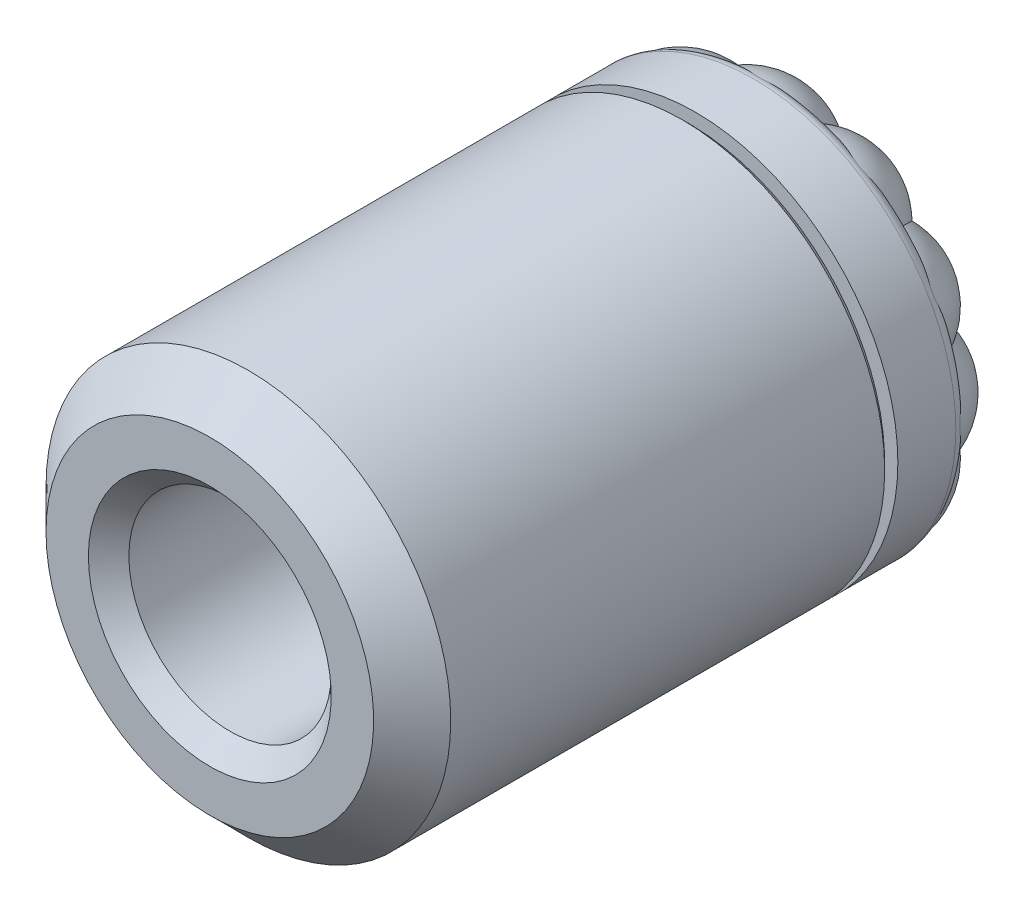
ISO-10303-21;
HEADER;
FILE_DESCRIPTION(('STEP AP214'),'2;1');
FILE_NAME('part.step','',(''),(''),'','','');
FILE_SCHEMA(('AUTOMOTIVE_DESIGN { 1 0 10303 214 1 1 1 1 }'));
ENDSEC;
DATA;
#1=APPLICATION_CONTEXT('core data for automotive mechanical design processes');
#2=APPLICATION_PROTOCOL_DEFINITION('international standard','automotive_design',2000,#1);
#3=PRODUCT_CONTEXT('',#1,'mechanical');
#4=PRODUCT('Part','Part','',(#3));
#5=PRODUCT_RELATED_PRODUCT_CATEGORY('part','',(#4));
#6=PRODUCT_DEFINITION_FORMATION('','',#4);
#7=PRODUCT_DEFINITION_CONTEXT('part definition',#1,'design');
#8=PRODUCT_DEFINITION('design','',#6,#7);
#9=PRODUCT_DEFINITION_SHAPE('','',#8);
#10=(LENGTH_UNIT() NAMED_UNIT(*) SI_UNIT(.MILLI.,.METRE.));
#11=(NAMED_UNIT(*) PLANE_ANGLE_UNIT() SI_UNIT($,.RADIAN.));
#12=(NAMED_UNIT(*) SI_UNIT($,.STERADIAN.) SOLID_ANGLE_UNIT());
#13=UNCERTAINTY_MEASURE_WITH_UNIT(LENGTH_MEASURE(1.E-05),#10,'distance_accuracy_value','');
#14=(GEOMETRIC_REPRESENTATION_CONTEXT(3) GLOBAL_UNCERTAINTY_ASSIGNED_CONTEXT((#13)) GLOBAL_UNIT_ASSIGNED_CONTEXT((#10,
#11,#12)) REPRESENTATION_CONTEXT('',''));
#15=CARTESIAN_POINT('',(0.,0.,0.));
#16=DIRECTION('',(0.,0.,1.));
#17=DIRECTION('',(1.,0.,0.));
#18=AXIS2_PLACEMENT_3D('',#15,#16,#17);
#19=CARTESIAN_POINT('',(0.,0.,12.));
#20=DIRECTION('',(0.,0.,-1.));
#21=DIRECTION('',(-1.,0.,0.));
#22=AXIS2_PLACEMENT_3D('',#19,#20,#21);
#23=PLANE('',#22);
#24=CARTESIAN_POINT('',(0.,0.,12.));
#25=DIRECTION('',(0.,0.,-1.));
#26=DIRECTION('',(-1.,0.,0.));
#27=AXIS2_PLACEMENT_3D('',#24,#25,#26);
#28=CIRCLE('',#27,2.4);
#29=CARTESIAN_POINT('',(-2.4,0.,12.));
#30=VERTEX_POINT('',#29);
#31=EDGE_CURVE('E22',#30,#30,#28,.T.);
#32=ORIENTED_EDGE('',*,*,#31,.T.);
#33=EDGE_LOOP('',(#32));
#34=FACE_BOUND('',#33,.T.);
#35=CARTESIAN_POINT('',(0.,0.,12.));
#36=DIRECTION('',(0.,0.,-1.));
#37=DIRECTION('',(-1.,0.,0.));
#38=AXIS2_PLACEMENT_3D('',#35,#36,#37);
#39=CIRCLE('',#38,3.238);
#40=CARTESIAN_POINT('',(-3.238,0.,12.));
#41=VERTEX_POINT('',#40);
#42=EDGE_CURVE('E685',#41,#41,#39,.F.);
#43=ORIENTED_EDGE('',*,*,#42,.T.);
#44=EDGE_LOOP('',(#43));
#45=FACE_BOUND('',#44,.T.);
#46=ADVANCED_FACE('F14',(#34,#45),#23,.F.);
#47=CARTESIAN_POINT('',(0.,0.,2.));
#48=DIRECTION('',(0.,0.,1.));
#49=DIRECTION('',(1.,0.,0.));
#50=AXIS2_PLACEMENT_3D('',#47,#48,#49);
#51=CYLINDRICAL_SURFACE('',#50,4.);
#52=CARTESIAN_POINT('',(0.,0.,2.6604));
#53=DIRECTION('',(0.,0.,-1.));
#54=DIRECTION('',(-1.,0.,0.));
#55=AXIS2_PLACEMENT_3D('',#52,#53,#54);
#56=CIRCLE('',#55,4.);
#57=CARTESIAN_POINT('',(-4.,0.,2.6604));
#58=VERTEX_POINT('',#57);
#59=EDGE_CURVE('E583',#58,#58,#56,.F.);
#60=ORIENTED_EDGE('',*,*,#59,.T.);
#61=EDGE_LOOP('',(#60));
#62=FACE_BOUND('',#61,.T.);
#63=CARTESIAN_POINT('',(0.,0.,11.238));
#64=DIRECTION('',(0.,0.,-1.));
#65=DIRECTION('',(-1.,0.,0.));
#66=AXIS2_PLACEMENT_3D('',#63,#64,#65);
#67=CIRCLE('',#66,4.);
#68=CARTESIAN_POINT('',(-4.,0.,11.238));
#69=VERTEX_POINT('',#68);
#70=EDGE_CURVE('E688',#69,#69,#67,.T.);
#71=ORIENTED_EDGE('',*,*,#70,.T.);
#72=EDGE_LOOP('',(#71));
#73=FACE_BOUND('',#72,.T.);
#74=ADVANCED_FACE('F279',(#62,#73),#51,.T.);
#75=CARTESIAN_POINT('',(0.,0.,11.238));
#76=DIRECTION('',(0.,0.,-1.));
#77=DIRECTION('',(-1.,0.,0.));
#78=AXIS2_PLACEMENT_3D('',#75,#76,#77);
#79=CONICAL_SURFACE('',#78,4.,0.78539816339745);
#80=ORIENTED_EDGE('',*,*,#42,.F.);
#81=EDGE_LOOP('',(#80));
#82=FACE_BOUND('',#81,.T.);
#83=ORIENTED_EDGE('',*,*,#70,.F.);
#84=EDGE_LOOP('',(#83));
#85=FACE_BOUND('',#84,.T.);
#86=ADVANCED_FACE('F275',(#82,#85),#79,.T.);
#87=CARTESIAN_POINT('',(0.,0.,2.5334));
#88=DIRECTION('',(0.,0.,-1.));
#89=DIRECTION('',(-1.,0.,0.));
#90=AXIS2_PLACEMENT_3D('',#87,#88,#89);
#91=PLANE('',#90);
#92=CARTESIAN_POINT('',(0.,0.,2.5334));
#93=DIRECTION('',(0.,0.,-1.));
#94=DIRECTION('',(-1.,0.,0.));
#95=AXIS2_PLACEMENT_3D('',#92,#93,#94);
#96=CIRCLE('',#95,3.127);
#97=CARTESIAN_POINT('',(-3.127,0.,2.5334));
#98=VERTEX_POINT('',#97);
#99=EDGE_CURVE('E576',#98,#98,#96,.F.);
#100=ORIENTED_EDGE('',*,*,#99,.T.);
#101=EDGE_LOOP('',(#100));
#102=FACE_BOUND('',#101,.T.);
#103=CARTESIAN_POINT('',(0.,0.,2.5334));
#104=DIRECTION('',(0.,0.,-1.));
#105=DIRECTION('',(-1.,0.,0.));
#106=AXIS2_PLACEMENT_3D('',#103,#104,#105);
#107=CIRCLE('',#106,3.873);
#108=CARTESIAN_POINT('',(-3.873,0.,2.5334));
#109=VERTEX_POINT('',#108);
#110=EDGE_CURVE('E676',#109,#109,#107,.T.);
#111=ORIENTED_EDGE('',*,*,#110,.T.);
#112=EDGE_LOOP('',(#111));
#113=FACE_BOUND('',#112,.T.);
#114=ADVANCED_FACE('F278',(#102,#113),#91,.T.);
#115=CARTESIAN_POINT('',(0.,0.,2.5334));
#116=DIRECTION('',(0.,0.,-1.));
#117=DIRECTION('',(-1.,0.,0.));
#118=AXIS2_PLACEMENT_3D('',#115,#116,#117);
#119=CYLINDRICAL_SURFACE('',#118,3.);
#120=CARTESIAN_POINT('',(0.,0.,2.4064));
#121=DIRECTION('',(0.,0.,-1.));
#122=DIRECTION('',(-1.,0.,0.));
#123=AXIS2_PLACEMENT_3D('',#120,#121,#122);
#124=CIRCLE('',#123,3.);
#125=CARTESIAN_POINT('',(-3.,0.,2.4064));
#126=VERTEX_POINT('',#125);
#127=EDGE_CURVE('E579',#126,#126,#124,.T.);
#128=ORIENTED_EDGE('',*,*,#127,.T.);
#129=EDGE_LOOP('',(#128));
#130=FACE_BOUND('',#129,.T.);
#131=CARTESIAN_POINT('',(0.,0.,2.254));
#132=DIRECTION('',(0.,0.,-1.));
#133=DIRECTION('',(-1.,0.,0.));
#134=AXIS2_PLACEMENT_3D('',#131,#132,#133);
#135=CIRCLE('',#134,3.);
#136=CARTESIAN_POINT('',(-3.,0.,2.254));
#137=VERTEX_POINT('',#136);
#138=EDGE_CURVE('E679',#137,#137,#135,.F.);
#139=ORIENTED_EDGE('',*,*,#138,.T.);
#140=EDGE_LOOP('',(#139));
#141=FACE_BOUND('',#140,.T.);
#142=ADVANCED_FACE('F273',(#130,#141),#119,.T.);
#143=CARTESIAN_POINT('',(0.,0.,2.));
#144=DIRECTION('',(0.,0.,1.));
#145=DIRECTION('',(1.,0.,0.));
#146=AXIS2_PLACEMENT_3D('',#143,#144,#145);
#147=CONICAL_SURFACE('',#146,2.746,0.785398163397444);
#148=ORIENTED_EDGE('',*,*,#138,.F.);
#149=EDGE_LOOP('',(#148));
#150=FACE_BOUND('',#149,.T.);
#151=CARTESIAN_POINT('',(0.,0.,2.));
#152=DIRECTION('',(0.,0.,-1.));
#153=DIRECTION('',(-1.,0.,0.));
#154=AXIS2_PLACEMENT_3D('',#151,#152,#153);
#155=CIRCLE('',#154,2.746);
#156=CARTESIAN_POINT('',(-2.746,0.,2.));
#157=VERTEX_POINT('',#156);
#158=EDGE_CURVE('E682',#157,#157,#155,.T.);
#159=ORIENTED_EDGE('',*,*,#158,.F.);
#160=EDGE_LOOP('',(#159));
#161=FACE_BOUND('',#160,.T.);
#162=ADVANCED_FACE('F269',(#150,#161),#147,.T.);
#163=CARTESIAN_POINT('',(0.,0.,2.5334));
#164=DIRECTION('',(0.,0.,1.));
#165=DIRECTION('',(1.,0.,0.));
#166=AXIS2_PLACEMENT_3D('',#163,#164,#165);
#167=CONICAL_SURFACE('',#166,3.873,0.785398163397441);
#168=ORIENTED_EDGE('',*,*,#59,.F.);
#169=EDGE_LOOP('',(#168));
#170=FACE_BOUND('',#169,.T.);
#171=ORIENTED_EDGE('',*,*,#110,.F.);
#172=EDGE_LOOP('',(#171));
#173=FACE_BOUND('',#172,.T.);
#174=ADVANCED_FACE('F264',(#170,#173),#167,.T.);
#175=CARTESIAN_POINT('',(0.,0.,2.4064));
#176=DIRECTION('',(0.,0.,-1.));
#177=DIRECTION('',(-1.,0.,0.));
#178=AXIS2_PLACEMENT_3D('',#175,#176,#177);
#179=TOROIDAL_SURFACE('',#178,3.127,0.127);
#180=ORIENTED_EDGE('',*,*,#99,.F.);
#181=EDGE_LOOP('',(#180));
#182=FACE_BOUND('',#181,.T.);
#183=ORIENTED_EDGE('',*,*,#127,.F.);
#184=EDGE_LOOP('',(#183));
#185=FACE_BOUND('',#184,.T.);
#186=ADVANCED_FACE('F261',(#182,#185),#179,.F.);
#187=CARTESIAN_POINT('',(0.,0.,2.38125));
#188=DIRECTION('',(0.,0.,1.));
#189=DIRECTION('',(0.,1.,0.));
#190=AXIS2_PLACEMENT_3D('',#187,#188,#189);
#191=SPHERICAL_SURFACE('',#190,2.38125);
#192=CARTESIAN_POINT('',(0.,1.93145288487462,1.64727478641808));
#193=DIRECTION('',(0.,-0.934779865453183,0.355227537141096));
#194=DIRECTION('',(0.,0.355227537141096,0.934779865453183));
#195=AXIS2_PLACEMENT_3D('',#192,#193,#194);
#196=CIRCLE('',#195,1.18368986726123);
#197=CARTESIAN_POINT('',(0.411905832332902,1.53725349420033,0.6099406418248));
#198=VERTEX_POINT('',#197);
#199=CARTESIAN_POINT('',(-0.411905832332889,1.53725349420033,0.6099406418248));
#200=VERTEX_POINT('',#199);
#201=EDGE_CURVE('E248',#198,#200,#196,.F.);
#202=ORIENTED_EDGE('',*,*,#201,.F.);
#203=CARTESIAN_POINT('',(0.96572644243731,1.67268726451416,1.64727478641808));
#204=DIRECTION('',(-0.467389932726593,-0.809543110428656,0.355227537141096));
#205=DIRECTION('',(0.866025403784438,-0.5,0.));
#206=AXIS2_PLACEMENT_3D('',#203,#204,#205);
#207=CIRCLE('',#206,1.18368986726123);
#208=CARTESIAN_POINT('',(1.12534766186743,1.12534766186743,0.6099406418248));
#209=VERTEX_POINT('',#208);
#210=EDGE_CURVE('E193',#209,#198,#207,.F.);
#211=ORIENTED_EDGE('',*,*,#210,.F.);
#212=CARTESIAN_POINT('',(1.67268726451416,0.965726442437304,1.64727478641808));
#213=DIRECTION('',(-0.809543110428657,-0.46738993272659,0.355227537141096));
#214=DIRECTION('',(0.5,-0.86602540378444,0.));
#215=AXIS2_PLACEMENT_3D('',#212,#213,#214);
#216=CIRCLE('',#215,1.18368986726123);
#217=CARTESIAN_POINT('',(1.53725349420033,0.411905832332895,0.6099406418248));
#218=VERTEX_POINT('',#217);
#219=EDGE_CURVE('E194',#218,#209,#216,.F.);
#220=ORIENTED_EDGE('',*,*,#219,.F.);
#221=CARTESIAN_POINT('',(1.93145288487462,0.,1.64727478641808));
#222=DIRECTION('',(-0.934779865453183,0.,0.355227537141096));
#223=DIRECTION('',(0.355227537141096,0.,0.934779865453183));
#224=AXIS2_PLACEMENT_3D('',#221,#222,#223);
#225=CIRCLE('',#224,1.18368986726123);
#226=CARTESIAN_POINT('',(1.53725349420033,-0.411905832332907,0.6099406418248));
#227=VERTEX_POINT('',#226);
#228=EDGE_CURVE('E603',#227,#218,#225,.F.);
#229=ORIENTED_EDGE('',*,*,#228,.F.);
#230=CARTESIAN_POINT('',(1.67268726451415,-0.965726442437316,1.64727478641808));
#231=DIRECTION('',(-0.809543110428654,0.467389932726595,0.355227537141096));
#232=DIRECTION('',(-0.5,-0.866025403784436,0.));
#233=AXIS2_PLACEMENT_3D('',#230,#231,#232);
#234=CIRCLE('',#233,1.18368986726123);
#235=CARTESIAN_POINT('',(1.12534766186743,-1.12534766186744,0.6099406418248));
#236=VERTEX_POINT('',#235);
#237=EDGE_CURVE('E600',#236,#227,#234,.F.);
#238=ORIENTED_EDGE('',*,*,#237,.F.);
#239=CARTESIAN_POINT('',(0.965726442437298,-1.67268726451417,1.64727478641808));
#240=DIRECTION('',(-0.467389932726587,0.809543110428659,0.355227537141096));
#241=DIRECTION('',(-0.866025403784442,-0.5,0.));
#242=AXIS2_PLACEMENT_3D('',#239,#240,#241);
#243=CIRCLE('',#242,1.18368986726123);
#244=CARTESIAN_POINT('',(0.411905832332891,-1.53725349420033,0.6099406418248));
#245=VERTEX_POINT('',#244);
#246=EDGE_CURVE('E597',#245,#236,#243,.F.);
#247=ORIENTED_EDGE('',*,*,#246,.F.);
#248=CARTESIAN_POINT('',(0.,-1.93145288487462,1.64727478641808));
#249=DIRECTION('',(0.,0.934779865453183,0.355227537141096));
#250=DIRECTION('',(0.,0.355227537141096,-0.934779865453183));
#251=AXIS2_PLACEMENT_3D('',#248,#249,#250);
#252=CIRCLE('',#251,1.18368986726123);
#253=CARTESIAN_POINT('',(-0.411905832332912,-1.53725349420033,0.6099406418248));
#254=VERTEX_POINT('',#253);
#255=EDGE_CURVE('E594',#254,#245,#252,.F.);
#256=ORIENTED_EDGE('',*,*,#255,.F.);
#257=CARTESIAN_POINT('',(-0.965726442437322,-1.67268726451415,1.64727478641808));
#258=DIRECTION('',(0.467389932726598,0.809543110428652,0.355227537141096));
#259=DIRECTION('',(-0.866025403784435,0.500000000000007,0.));
#260=AXIS2_PLACEMENT_3D('',#257,#258,#259);
#261=CIRCLE('',#260,1.18368986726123);
#262=CARTESIAN_POINT('',(-1.12534766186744,-1.12534766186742,0.6099406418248));
#263=VERTEX_POINT('',#262);
#264=EDGE_CURVE('E591',#263,#254,#261,.F.);
#265=ORIENTED_EDGE('',*,*,#264,.F.);
#266=CARTESIAN_POINT('',(-1.67268726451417,-0.965726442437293,1.64727478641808));
#267=DIRECTION('',(0.809543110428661,0.467389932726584,0.355227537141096));
#268=DIRECTION('',(-0.499999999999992,0.866025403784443,0.));
#269=AXIS2_PLACEMENT_3D('',#266,#267,#268);
#270=CIRCLE('',#269,1.18368986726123);
#271=CARTESIAN_POINT('',(-1.53725349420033,-0.411905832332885,0.6099406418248));
#272=VERTEX_POINT('',#271);
#273=EDGE_CURVE('E588',#272,#263,#270,.F.);
#274=ORIENTED_EDGE('',*,*,#273,.F.);
#275=CARTESIAN_POINT('',(-1.93145288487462,0.,1.64727478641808));
#276=DIRECTION('',(0.934779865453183,0.,0.355227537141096));
#277=DIRECTION('',(0.355227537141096,0.,-0.934779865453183));
#278=AXIS2_PLACEMENT_3D('',#275,#276,#277);
#279=CIRCLE('',#278,1.18368986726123);
#280=CARTESIAN_POINT('',(-1.53725349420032,0.411905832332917,0.6099406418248));
#281=VERTEX_POINT('',#280);
#282=EDGE_CURVE('E29',#281,#272,#279,.F.);
#283=ORIENTED_EDGE('',*,*,#282,.F.);
#284=CARTESIAN_POINT('',(-1.67268726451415,0.965726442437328,1.64727478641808));
#285=DIRECTION('',(0.809543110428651,-0.467389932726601,0.355227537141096));
#286=DIRECTION('',(0.50000000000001,0.866025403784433,0.));
#287=AXIS2_PLACEMENT_3D('',#284,#285,#286);
#288=CIRCLE('',#287,1.18368986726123);
#289=CARTESIAN_POINT('',(-1.12534766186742,1.12534766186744,0.6099406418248));
#290=VERTEX_POINT('',#289);
#291=EDGE_CURVE('E174',#290,#281,#288,.F.);
#292=ORIENTED_EDGE('',*,*,#291,.F.);
#293=CARTESIAN_POINT('',(-0.965726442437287,1.67268726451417,1.64727478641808));
#294=DIRECTION('',(0.467389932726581,-0.809543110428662,0.355227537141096));
#295=DIRECTION('',(0.866025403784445,0.499999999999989,0.));
#296=AXIS2_PLACEMENT_3D('',#293,#294,#295);
#297=CIRCLE('',#296,1.18368986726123);
#298=EDGE_CURVE('E177',#200,#290,#297,.F.);
#299=ORIENTED_EDGE('',*,*,#298,.F.);
#300=EDGE_LOOP('',(#202,#211,#220,#229,#238,#247,#256,#265,#274,#283,#292,#299));
#301=FACE_BOUND('',#300,.T.);
#302=ADVANCED_FACE('F176',(#301),#191,.T.);
#303=CARTESIAN_POINT('',(0.,0.,1.));
#304=DIRECTION('',(0.,0.,1.));
#305=DIRECTION('',(1.,0.,0.));
#306=AXIS2_PLACEMENT_3D('',#303,#304,#305);
#307=PLANE('',#306);
#308=CARTESIAN_POINT('',(1.30546875,2.26113820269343,1.));
#309=DIRECTION('',(0.,0.,1.));
#310=DIRECTION('',(0.866025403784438,-0.5,0.));
#311=AXIS2_PLACEMENT_3D('',#308,#309,#310);
#312=CIRCLE('',#311,1.33346353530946);
#313=CARTESIAN_POINT('',(2.54749753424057,2.74641080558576,1.));
#314=VERTEX_POINT('',#313);
#315=CARTESIAN_POINT('',(2.59616045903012,2.59616045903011,1.));
#316=VERTEX_POINT('',#315);
#317=EDGE_CURVE('E560',#314,#316,#312,.F.);
#318=ORIENTED_EDGE('',*,*,#317,.F.);
#319=CARTESIAN_POINT('',(0.,0.,1.));
#320=DIRECTION('',(0.,0.,-1.));
#321=DIRECTION('',(-1.,0.,0.));
#322=AXIS2_PLACEMENT_3D('',#319,#320,#321);
#323=CIRCLE('',#322,3.746);
#324=CARTESIAN_POINT('',(2.74641080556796,2.54749753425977,1.));
#325=VERTEX_POINT('',#324);
#326=EDGE_CURVE('E396',#314,#325,#323,.T.);
#327=ORIENTED_EDGE('',*,*,#326,.T.);
#328=CARTESIAN_POINT('',(2.26113820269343,1.30546874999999,1.));
#329=DIRECTION('',(0.,0.,1.));
#330=DIRECTION('',(0.5,-0.86602540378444,0.));
#331=AXIS2_PLACEMENT_3D('',#328,#329,#330);
#332=CIRCLE('',#331,1.33346353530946);
#333=EDGE_CURVE('E544',#316,#325,#332,.F.);
#334=ORIENTED_EDGE('',*,*,#333,.F.);
#335=EDGE_LOOP('',(#318,#327,#334));
#336=FACE_BOUND('',#335,.T.);
#337=ADVANCED_FACE('F260',(#336),#307,.F.);
#338=CARTESIAN_POINT('',(2.26113820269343,1.30546874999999,1.3890625));
#339=DIRECTION('',(0.,0.,-1.));
#340=DIRECTION('',(0.86602540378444,0.5,0.));
#341=AXIS2_PLACEMENT_3D('',#338,#339,#340);
#342=SPHERICAL_SURFACE('',#341,1.3890625);
#343=CARTESIAN_POINT('',(2.43603785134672,0.652734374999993,1.3890625));
#344=DIRECTION('',(0.258819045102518,-0.965925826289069,0.));
#345=DIRECTION('',(0.965925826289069,0.258819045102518,0.));
#346=AXIS2_PLACEMENT_3D('',#343,#344,#345);
#347=CIRCLE('',#346,1.21360725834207);
#348=CARTESIAN_POINT('',(3.54642113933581,0.950260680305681,1.));
#349=VERTEX_POINT('',#348);
#350=EDGE_CURVE('E550',#218,#349,#347,.T.);
#351=ORIENTED_EDGE('',*,*,#350,.F.);
#352=ORIENTED_EDGE('',*,*,#219,.T.);
#353=CARTESIAN_POINT('',(1.78330347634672,1.78330347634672,1.3890625));
#354=DIRECTION('',(0.707106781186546,-0.707106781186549,0.));
#355=DIRECTION('',(0.707106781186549,0.707106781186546,0.));
#356=AXIS2_PLACEMENT_3D('',#353,#354,#355);
#357=CIRCLE('',#356,1.21360725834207);
#358=EDGE_CURVE('E37',#209,#316,#357,.T.);
#359=ORIENTED_EDGE('',*,*,#358,.T.);
#360=ORIENTED_EDGE('',*,*,#333,.T.);
#361=CARTESIAN_POINT('',(2.22953571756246,2.68760767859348,1.2542));
#362=CARTESIAN_POINT('',(2.23078298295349,2.68654361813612,1.24299217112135));
#363=CARTESIAN_POINT('',(2.23333667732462,2.68539226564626,1.23202407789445));
#364=CARTESIAN_POINT('',(2.2405237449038,2.68295750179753,1.21097101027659));
#365=CARTESIAN_POINT('',(2.24512695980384,2.68167620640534,1.20087567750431));
#366=CARTESIAN_POINT('',(2.25589768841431,2.67900356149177,1.1817188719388));
#367=CARTESIAN_POINT('',(2.26205176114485,2.6776132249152,1.1726494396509));
#368=CARTESIAN_POINT('',(2.2755588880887,2.67471129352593,1.15543045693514));
#369=CARTESIAN_POINT('',(2.28291677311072,2.67319922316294,1.14728484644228));
#370=CARTESIAN_POINT('',(2.30458463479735,2.66882522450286,1.12590236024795));
#371=CARTESIAN_POINT('',(2.31983903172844,2.6658307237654,1.11365290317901));
#372=CARTESIAN_POINT('',(2.35193631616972,2.65941644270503,1.09162689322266));
#373=CARTESIAN_POINT('',(2.36878278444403,2.6559956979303,1.08185610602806));
#374=CARTESIAN_POINT('',(2.4160977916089,2.64600147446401,1.05797302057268));
#375=CARTESIAN_POINT('',(2.44750345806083,2.63895436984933,1.04592491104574));
#376=CARTESIAN_POINT('',(2.51131880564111,2.62328626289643,1.02651038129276));
#377=CARTESIAN_POINT('',(2.5437306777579,2.61466159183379,1.01915505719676));
#378=CARTESIAN_POINT('',(2.6296240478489,2.58962581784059,1.00458833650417));
#379=CARTESIAN_POINT('',(2.6832257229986,2.57177822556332,1.00052307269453));
#380=CARTESIAN_POINT('',(2.78854939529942,2.5313673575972,0.99957262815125));
#381=CARTESIAN_POINT('',(2.84027075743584,2.50880250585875,1.00268985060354));
#382=CARTESIAN_POINT('',(2.95670330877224,2.45093769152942,1.01611860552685));
#383=CARTESIAN_POINT('',(3.02032631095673,2.41386889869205,1.02839973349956));
#384=CARTESIAN_POINT('',(3.11055282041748,2.35200504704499,1.05118168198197));
#385=CARTESIAN_POINT('',(3.13987462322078,2.33023337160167,1.05954773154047));
#386=CARTESIAN_POINT('',(3.19653096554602,2.28460156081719,1.07724357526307));
#387=CARTESIAN_POINT('',(3.22386653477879,2.26074252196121,1.08657286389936));
#388=CARTESIAN_POINT('',(3.26827659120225,2.21856225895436,1.10253605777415));
#389=CARTESIAN_POINT('',(3.28591319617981,2.20080589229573,1.10911274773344));
#390=CARTESIAN_POINT('',(3.3201075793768,2.16418407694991,1.12194018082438));
#391=CARTESIAN_POINT('',(3.33666598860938,2.14531928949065,1.12819111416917));
#392=CARTESIAN_POINT('',(3.36833911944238,2.10669450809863,1.13950000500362));
#393=CARTESIAN_POINT('',(3.38347550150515,2.08695874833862,1.14457861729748));
#394=CARTESIAN_POINT('',(3.41242795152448,2.04614439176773,1.15228724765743));
#395=CARTESIAN_POINT('',(3.42624952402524,2.02507207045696,1.15492791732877));
#396=CARTESIAN_POINT('',(3.45026824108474,1.98499102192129,1.15630540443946));
#397=CARTESIAN_POINT('',(3.46069858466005,1.96614254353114,1.15556519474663));
#398=CARTESIAN_POINT('',(3.48020086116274,1.92796257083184,1.15168616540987));
#399=CARTESIAN_POINT('',(3.48926877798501,1.90862983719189,1.14854041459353));
#400=CARTESIAN_POINT('',(3.50625896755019,1.86938924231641,1.14078294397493));
#401=CARTESIAN_POINT('',(3.51415975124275,1.84947716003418,1.13614778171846));
#402=CARTESIAN_POINT('',(3.52877955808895,1.80941437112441,1.12619684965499));
#403=CARTESIAN_POINT('',(3.53549922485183,1.78926380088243,1.12088145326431));
#404=CARTESIAN_POINT('',(3.55266042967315,1.73295955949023,1.10582126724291));
#405=CARTESIAN_POINT('',(3.56194756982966,1.69651290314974,1.09583787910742));
#406=CARTESIAN_POINT('',(3.57741418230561,1.62281600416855,1.07646171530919));
#407=CARTESIAN_POINT('',(3.58359208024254,1.58556536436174,1.06706924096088));
#408=CARTESIAN_POINT('',(3.59757887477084,1.47326708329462,1.04090719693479));
#409=CARTESIAN_POINT('',(3.60099549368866,1.39714731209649,1.02598913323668));
#410=CARTESIAN_POINT('',(3.59742915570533,1.2626878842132,1.00771563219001));
#411=CARTESIAN_POINT('',(3.59277462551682,1.20452923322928,1.002429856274));
#412=CARTESIAN_POINT('',(3.57781276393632,1.08864546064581,0.998871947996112));
#413=CARTESIAN_POINT('',(3.56751075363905,1.03091998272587,1.00059322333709));
#414=CARTESIAN_POINT('',(3.54800416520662,0.94289755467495,1.01082415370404));
#415=CARTESIAN_POINT('',(3.54035923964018,0.911849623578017,1.01596393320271));
#416=CARTESIAN_POINT('',(3.52402692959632,0.850850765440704,1.02993823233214));
#417=CARTESIAN_POINT('',(3.51534051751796,0.8208988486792,1.03876932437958));
#418=CARTESIAN_POINT('',(3.50019031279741,0.771606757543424,1.05777691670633));
#419=CARTESIAN_POINT('',(3.49383954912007,0.751773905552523,1.06675936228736));
#420=CARTESIAN_POINT('',(3.48127665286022,0.713571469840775,1.0875274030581));
#421=CARTESIAN_POINT('',(3.47506425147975,0.695198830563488,1.09930692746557));
#422=CARTESIAN_POINT('',(3.46574453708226,0.667764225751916,1.12085657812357));
#423=CARTESIAN_POINT('',(3.46239283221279,0.657928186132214,1.12953124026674));
#424=CARTESIAN_POINT('',(3.45617481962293,0.639455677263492,1.14825025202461));
#425=CARTESIAN_POINT('',(3.45330814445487,0.630818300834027,1.1582935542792));
#426=CARTESIAN_POINT('',(3.44893354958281,0.61705964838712,1.17731357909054));
#427=CARTESIAN_POINT('',(3.44726469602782,0.611587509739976,1.1859973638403));
#428=CARTESIAN_POINT('',(3.44456515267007,0.60197130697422,1.20414848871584));
#429=CARTESIAN_POINT('',(3.44353222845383,0.597822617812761,1.21361295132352));
#430=CARTESIAN_POINT('',(3.44257983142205,0.592798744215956,1.22837691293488));
#431=CARTESIAN_POINT('',(3.44236296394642,0.591314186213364,1.23345428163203));
#432=CARTESIAN_POINT('',(3.4421572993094,0.588811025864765,1.24374104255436));
#433=CARTESIAN_POINT('',(3.44216911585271,0.587793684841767,1.24895075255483));
#434=CARTESIAN_POINT('',(3.4423043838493,0.587030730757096,1.2542));
#435=B_SPLINE_CURVE_WITH_KNOTS('',3,(#361,#362,#363,#364,#365,#366,#367,#368,#369,#370,#371,
#372,#373,#374,#375,#376,#377,#378,#379,#380,#381,#382,#383,#384,#385,#386,#387,#388,#389,#390,
#391,#392,#393,#394,#395,#396,#397,#398,#399,#400,#401,#402,#403,#404,#405,#406,#407,#408,#409,
#410,#411,#412,#413,#414,#415,#416,#417,#418,#419,#420,#421,#422,#423,#424,#425,#426,#427,#428,
#429,#430,#431,#432,#433,#434),.UNSPECIFIED.,.F.,.F.,(4,2,2,2,2,2,2,2,2,2,2,2,2,2,2,2,2,2,2,2,2,
2,2,2,2,2,2,2,2,2,2,2,2,2,2,2,4),(0.,0.0337831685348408,0.0670848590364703,0.100107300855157,
0.133265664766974,0.192299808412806,0.251470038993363,0.353992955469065,0.456757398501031,
0.625733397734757,0.794765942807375,1.01745457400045,1.12976568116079,1.24201814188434,
1.31960951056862,1.39715505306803,1.47320732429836,1.54892572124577,1.61336391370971,
1.67798847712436,1.74368458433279,1.80934478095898,1.92591955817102,2.04255330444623,
2.27412506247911,2.4493433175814,2.62439676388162,2.7213791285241,2.81827163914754,
2.88616012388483,2.95390258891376,2.99441599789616,3.03489857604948,3.06599129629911,
3.09697413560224,3.11283290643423,3.12873424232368),.UNSPECIFIED.);
#436=CARTESIAN_POINT('',(3.57940298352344,1.10471275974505,1.));
#437=VERTEX_POINT('',#436);
#438=EDGE_CURVE('E536',#325,#437,#435,.T.);
#439=ORIENTED_EDGE('',*,*,#438,.T.);
#440=EDGE_CURVE('E547',#437,#349,#332,.F.);
#441=ORIENTED_EDGE('',*,*,#440,.T.);
#442=EDGE_LOOP('',(#351,#352,#359,#360,#439,#441));
#443=FACE_BOUND('',#442,.T.);
#444=ADVANCED_FACE('F256',(#443),#342,.T.);
#445=ORIENTED_EDGE('',*,*,#440,.F.);
#446=CARTESIAN_POINT('',(3.65221029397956,0.832992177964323,1.));
#447=VERTEX_POINT('',#446);
#448=EDGE_CURVE('E400',#437,#447,#323,.T.);
#449=ORIENTED_EDGE('',*,*,#448,.T.);
#450=CARTESIAN_POINT('',(2.6109375,0.,1.));
#451=DIRECTION('',(0.,0.,1.));
#452=DIRECTION('',(0.,-1.,0.));
#453=AXIS2_PLACEMENT_3D('',#450,#451,#452);
#454=CIRCLE('',#453,1.33346353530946);
#455=EDGE_CURVE('E606',#349,#447,#454,.F.);
#456=ORIENTED_EDGE('',*,*,#455,.F.);
#457=EDGE_LOOP('',(#445,#449,#456));
#458=FACE_BOUND('',#457,.T.);
#459=ADVANCED_FACE('F513',(#458),#307,.F.);
#460=CARTESIAN_POINT('',(2.6109375,0.,1.3890625));
#461=DIRECTION('',(0.,0.,-1.));
#462=DIRECTION('',(1.,0.,0.));
#463=AXIS2_PLACEMENT_3D('',#460,#461,#462);
#464=SPHERICAL_SURFACE('',#463,1.3890625);
#465=CARTESIAN_POINT('',(2.43603785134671,-0.65273437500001,1.3890625));
#466=DIRECTION('',(-0.258819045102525,-0.965925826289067,0.));
#467=DIRECTION('',(0.965925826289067,-0.258819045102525,0.));
#468=AXIS2_PLACEMENT_3D('',#465,#466,#467);
#469=CIRCLE('',#468,1.21360725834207);
#470=CARTESIAN_POINT('',(3.5464211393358,-0.950260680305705,1.));
#471=VERTEX_POINT('',#470);
#472=EDGE_CURVE('E545',#227,#471,#469,.T.);
#473=ORIENTED_EDGE('',*,*,#472,.F.);
#474=ORIENTED_EDGE('',*,*,#228,.T.);
#475=ORIENTED_EDGE('',*,*,#350,.T.);
#476=ORIENTED_EDGE('',*,*,#455,.T.);
#477=CARTESIAN_POINT('',(3.2746384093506,1.21276866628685,1.2542));
#478=CARTESIAN_POINT('',(3.27518654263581,1.21122353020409,1.24299217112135));
#479=CARTESIAN_POINT('',(3.27682243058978,1.2089495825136,1.23202407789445));
#480=CARTESIAN_POINT('',(3.2818292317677,1.20324748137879,1.21097101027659));
#481=CARTESIAN_POINT('',(3.28517508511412,1.19983623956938,1.20087567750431));
#482=CARTESIAN_POINT('',(3.29316648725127,1.1921362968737,1.1817188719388));
#483=CARTESIAN_POINT('',(3.29780090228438,1.18785519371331,1.1726494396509));
#484=CARTESIAN_POINT('',(3.30804745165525,1.17858848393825,1.15543045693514));
#485=CARTESIAN_POINT('',(3.31366353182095,1.17360005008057,1.14728484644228));
#486=CARTESIAN_POINT('',(3.33024145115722,1.15897812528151,1.12590236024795));
#487=CARTESIAN_POINT('',(3.34195489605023,1.14875761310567,1.11365290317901));
#488=CARTESIAN_POINT('',(3.36654481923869,1.12715404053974,1.09162689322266));
#489=CARTESIAN_POINT('',(3.37942391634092,1.11576835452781,1.08185610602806));
#490=CARTESIAN_POINT('',(3.41540280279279,1.08345559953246,1.05797302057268));
#491=CARTESIAN_POINT('',(3.4390773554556,1.06164979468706,1.04592491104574));
#492=CARTESIAN_POINT('',(3.48650901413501,1.01617314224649,1.02651038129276));
#493=CARTESIAN_POINT('',(3.51026618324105,0.992498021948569,1.01915505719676));
#494=CARTESIAN_POINT('',(3.57213413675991,0.927869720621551,1.00458833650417));
#495=CARTESIAN_POINT('',(3.60963075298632,0.885612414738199,1.00052307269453));
#496=CARTESIAN_POINT('',(3.68063829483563,0.797953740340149,0.99957262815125));
#497=CARTESIAN_POINT('',(3.71414788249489,0.75255132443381,1.00268985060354));
#498=CARTESIAN_POINT('',(3.78604902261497,0.644222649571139,1.01611860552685));
#499=CARTESIAN_POINT('',(3.8226137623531,0.580308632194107,1.02839973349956));
#500=CARTESIAN_POINT('',(3.86982028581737,0.481619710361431,1.05118168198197));
#501=CARTESIAN_POINT('',(3.88432787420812,0.448103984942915,1.05954773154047));
#502=CARTESIAN_POINT('',(3.91057780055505,0.380257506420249,1.07724357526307));
#503=CARTESIAN_POINT('',(3.92232157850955,0.345927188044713,1.08657286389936));
#504=CARTESIAN_POINT('',(3.93969168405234,0.287192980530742,1.10253605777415));
#505=CARTESIAN_POINT('',(3.9460872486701,0.262997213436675,1.10911274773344));
#506=CARTESIAN_POINT('',(3.95738954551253,0.21418459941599,1.12194018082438));
#507=CARTESIAN_POINT('',(3.96229715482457,0.189568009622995,1.12819111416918));
#508=CARTESIAN_POINT('',(3.97041450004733,0.140281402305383,1.13950000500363));
#509=CARTESIAN_POINT('',(3.97365511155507,0.115621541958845,1.14457861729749));
#510=CARTESIAN_POINT('',(3.97832149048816,0.0657990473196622,1.15228724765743));
#511=CARTESIAN_POINT('',(3.97975516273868,0.0406390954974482,1.15492791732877));
#512=CARTESIAN_POINT('',(3.98051545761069,-0.00608146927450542,1.15630540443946));
#513=CARTESIAN_POINT('',(3.98012416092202,-0.0276199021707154,1.15556519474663));
#514=CARTESIAN_POINT('',(3.97792364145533,-0.0704358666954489,1.15168616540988));
#515=CARTESIAN_POINT('',(3.97611032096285,-0.0917124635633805,1.14854041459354));
#516=CARTESIAN_POINT('',(3.97120395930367,-0.134190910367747,1.14078294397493));
#517=CARTESIAN_POINT('',(3.96809019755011,-0.155385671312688,1.13614778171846));
#518=CARTESIAN_POINT('',(3.96071992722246,-0.197390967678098,1.12619684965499));
#519=CARTESIAN_POINT('',(3.95646404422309,-0.218201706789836,1.12088145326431));
#520=CARTESIAN_POINT('',(3.9431739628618,-0.275543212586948,1.10582126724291));
#521=CARTESIAN_POINT('',(3.9329935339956,-0.311750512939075,1.09583787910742));
#522=CARTESIAN_POINT('',(3.90953956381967,-0.383307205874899,1.07646171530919));
#523=CARTESIAN_POINT('',(3.89626446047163,-0.418656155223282,1.06706924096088));
#524=CARTESIAN_POINT('',(3.85222823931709,-0.522902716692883,1.0409071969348));
#525=CARTESIAN_POINT('',(3.81712723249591,-0.590532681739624,1.02598913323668));
#526=CARTESIAN_POINT('',(3.74680897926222,-0.705194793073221,1.00771563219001));
#527=CARTESIAN_POINT('',(3.71369871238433,-0.753234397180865,1.002429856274));
#528=CARTESIAN_POINT('',(3.64279947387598,-0.846111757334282,0.998871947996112));
#529=CARTESIAN_POINT('',(3.60501493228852,-0.890952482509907,1.00059322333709));
#530=CARTESIAN_POINT('',(3.5441105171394,-0.957428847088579,1.01082415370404));
#531=CARTESIAN_POINT('',(3.52196585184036,-0.980494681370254,1.01596393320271));
#532=CARTESIAN_POINT('',(3.47732222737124,-1.02515508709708,1.02993823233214));
#533=CARTESIAN_POINT('',(3.45482361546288,-1.0467510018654,1.03876932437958));
#534=CARTESIAN_POINT('',(3.41705710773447,-1.08186410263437,1.05777691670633));
#535=CARTESIAN_POINT('',(3.40164075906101,-1.09586447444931,1.06675936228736));
#536=CARTESIAN_POINT('',(3.371659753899,-1.1226673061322,1.0875274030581));
#537=CARTESIAN_POINT('',(3.35709333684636,-1.13547227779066,1.09930692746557));
#538=CARTESIAN_POINT('',(3.33530492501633,-1.15457148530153,1.12085657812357));
#539=CARTESIAN_POINT('',(3.32748424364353,-1.16141389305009,1.12953124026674));
#540=CARTESIAN_POINT('',(3.3128630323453,-1.1743025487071,1.14825025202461));
#541=CARTESIAN_POINT('',(3.30606173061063,-1.18034939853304,1.1582935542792));
#542=CARTESIAN_POINT('',(3.29539389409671,-1.19007744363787,1.17731357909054));
#543=CARTESIAN_POINT('',(3.29121255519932,-1.19398202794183,1.1859973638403));
#544=CARTESIAN_POINT('',(3.28406658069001,-1.20096013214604,1.20414848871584));
#545=CARTESIAN_POINT('',(3.28109769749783,-1.20403654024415,1.21361295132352));
#546=CARTESIAN_POINT('',(3.27776096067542,-1.2079111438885,1.22837691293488));
#547=CARTESIAN_POINT('',(3.27683086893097,-1.20908837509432,1.23345428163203));
#548=CARTESIAN_POINT('',(3.27540117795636,-1.21115334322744,1.24374104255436));
#549=CARTESIAN_POINT('',(3.27490274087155,-1.21204029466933,1.24895075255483));
#550=CARTESIAN_POINT('',(3.27463840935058,-1.21276866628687,1.2542));
#551=B_SPLINE_CURVE_WITH_KNOTS('',3,(#477,#478,#479,#480,#481,#482,#483,#484,#485,#486,#487,
#488,#489,#490,#491,#492,#493,#494,#495,#496,#497,#498,#499,#500,#501,#502,#503,#504,#505,#506,
#507,#508,#509,#510,#511,#512,#513,#514,#515,#516,#517,#518,#519,#520,#521,#522,#523,#524,#525,
#526,#527,#528,#529,#530,#531,#532,#533,#534,#535,#536,#537,#538,#539,#540,#541,#542,#543,#544,
#545,#546,#547,#548,#549,#550),.UNSPECIFIED.,.F.,.F.,(4,2,2,2,2,2,2,2,2,2,2,2,2,2,2,2,2,2,2,2,2,
2,2,2,2,2,2,2,2,2,2,2,2,2,2,2,4),(0.,0.0337831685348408,0.0670848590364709,0.100107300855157,
0.133265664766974,0.192299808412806,0.251470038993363,0.353992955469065,0.45675739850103,
0.625733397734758,0.794765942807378,1.01745457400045,1.1297656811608,1.24201814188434,
1.31960951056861,1.39715505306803,1.47320732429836,1.54892572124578,1.61336391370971,
1.67798847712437,1.74368458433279,1.80934478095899,1.92591955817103,2.04255330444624,
2.27412506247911,2.4493433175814,2.62439676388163,2.7213791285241,2.81827163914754,
2.88616012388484,2.95390258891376,2.99441599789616,3.03489857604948,3.06599129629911,
3.09697413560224,3.11283290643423,3.12873424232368),.UNSPECIFIED.);
#552=CARTESIAN_POINT('',(3.65221029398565,-0.832992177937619,1.));
#553=VERTEX_POINT('',#552);
#554=EDGE_CURVE('E609',#447,#553,#551,.T.);
#555=ORIENTED_EDGE('',*,*,#554,.T.);
#556=EDGE_CURVE('E608',#553,#471,#454,.F.);
#557=ORIENTED_EDGE('',*,*,#556,.T.);
#558=EDGE_LOOP('',(#473,#474,#475,#476,#555,#557));
#559=FACE_BOUND('',#558,.T.);
#560=ADVANCED_FACE('F509',(#559),#464,.T.);
#561=ORIENTED_EDGE('',*,*,#556,.F.);
#562=CARTESIAN_POINT('',(3.57940298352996,-1.10471275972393,1.));
#563=VERTEX_POINT('',#562);
#564=EDGE_CURVE('E403',#553,#563,#323,.T.);
#565=ORIENTED_EDGE('',*,*,#564,.T.);
#566=CARTESIAN_POINT('',(2.26113820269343,-1.30546875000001,1.));
#567=DIRECTION('',(0.,0.,1.));
#568=DIRECTION('',(-0.5,-0.866025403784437,0.));
#569=AXIS2_PLACEMENT_3D('',#566,#567,#568);
#570=CIRCLE('',#569,1.33346353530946);
#571=EDGE_CURVE('E622',#471,#563,#570,.F.);
#572=ORIENTED_EDGE('',*,*,#571,.F.);
#573=EDGE_LOOP('',(#561,#565,#572));
#574=FACE_BOUND('',#573,.T.);
#575=ADVANCED_FACE('F502',(#574),#307,.F.);
#576=CARTESIAN_POINT('',(2.26113820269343,-1.30546875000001,1.3890625));
#577=DIRECTION('',(0.,0.,-1.));
#578=DIRECTION('',(0.866025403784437,-0.5,0.));
#579=AXIS2_PLACEMENT_3D('',#576,#577,#578);
#580=SPHERICAL_SURFACE('',#579,1.3890625);
#581=CARTESIAN_POINT('',(1.78330347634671,-1.78330347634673,1.3890625));
#582=DIRECTION('',(-0.707106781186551,-0.707106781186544,0.));
#583=DIRECTION('',(0.707106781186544,-0.707106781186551,0.));
#584=AXIS2_PLACEMENT_3D('',#581,#582,#583);
#585=CIRCLE('',#584,1.21360725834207);
#586=CARTESIAN_POINT('',(2.5961604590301,-2.59616045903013,1.));
#587=VERTEX_POINT('',#586);
#588=EDGE_CURVE('E611',#236,#587,#585,.T.);
#589=ORIENTED_EDGE('',*,*,#588,.F.);
#590=ORIENTED_EDGE('',*,*,#237,.T.);
#591=ORIENTED_EDGE('',*,*,#472,.T.);
#592=ORIENTED_EDGE('',*,*,#571,.T.);
#593=CARTESIAN_POINT('',(3.4423043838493,-0.587030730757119,1.2542));
#594=CARTESIAN_POINT('',(3.44200651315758,-0.588642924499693,1.24299217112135));
#595=CARTESIAN_POINT('',(3.44228625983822,-0.591430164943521,1.23202407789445));
#596=CARTESIAN_POINT('',(3.44377122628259,-0.598871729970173,1.21097101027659));
#597=CARTESIAN_POINT('',(3.44496319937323,-0.603498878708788,1.20087567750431));
#598=CARTESIAN_POINT('',(3.44803398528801,-0.614162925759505,1.1817188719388));
#599=CARTESIAN_POINT('',(3.44990695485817,-0.620187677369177,1.1726494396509));
#600=CARTESIAN_POINT('',(3.45414737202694,-0.633336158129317,1.15543045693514));
#601=CARTESIAN_POINT('',(3.45651682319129,-0.640464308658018,1.14728484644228));
#602=CARTESIAN_POINT('',(3.46356276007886,-0.66141622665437,1.12590236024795));
#603=CARTESIAN_POINT('',(3.46859664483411,-0.676124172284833,1.11365290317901));
#604=CARTESIAN_POINT('',(3.47909035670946,-0.707128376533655,1.09162689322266));
#605=CARTESIAN_POINT('',(3.48455113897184,-0.72342821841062,1.08185610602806));
#606=CARTESIAN_POINT('',(3.49955339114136,-0.769401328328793,1.05797302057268));
#607=CARTESIAN_POINT('',(3.50915325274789,-0.800122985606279,1.04592491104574));
#608=CARTESIAN_POINT('',(3.52749194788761,-0.863222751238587,1.02651038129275));
#609=CARTESIAN_POINT('',(3.53622869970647,-0.895604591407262,1.01915505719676));
#610=CARTESIAN_POINT('',(3.55749376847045,-0.982508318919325,1.00458833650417));
#611=CARTESIAN_POINT('',(3.5688381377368,-1.037852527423,1.00052307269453));
#612=CARTESIAN_POINT('',(3.58650313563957,-1.14927093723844,0.999572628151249));
#613=CARTESIAN_POINT('',(3.59282208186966,-1.20534537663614,1.00268985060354));
#614=CARTESIAN_POINT('',(3.60092595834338,-1.33511133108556,1.01611860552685));
#615=CARTESIAN_POINT('',(3.60063494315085,-1.40874486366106,1.02839973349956));
#616=CARTESIAN_POINT('',(3.59217253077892,-1.51781523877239,1.05118168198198));
#617=CARTESIAN_POINT('',(3.5879786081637,-1.55409450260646,1.05954773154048));
#618=CARTESIAN_POINT('',(3.57678847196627,-1.62597623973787,1.07724357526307));
#619=CARTESIAN_POINT('',(3.5697937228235,-1.66157905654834,1.08657286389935));
#620=CARTESIAN_POINT('',(3.55546957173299,-1.72112942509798,1.10253605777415));
#621=CARTESIAN_POINT('',(3.54891040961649,-1.74528135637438,1.10911274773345));
#622=CARTESIAN_POINT('',(3.5342921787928,-1.79320546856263,1.12194018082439));
#623=CARTESIAN_POINT('',(3.52623399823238,-1.81697786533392,1.12819111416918));
#624=CARTESIAN_POINT('',(3.50862052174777,-1.8637199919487,1.13950000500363));
#625=CARTESIAN_POINT('',(3.499097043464,-1.88669636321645,1.1445786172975));
#626=CARTESIAN_POINT('',(3.47822699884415,-1.93217709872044,1.15228724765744));
#627=CARTESIAN_POINT('',(3.46688861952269,-1.95468309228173,1.15492791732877));
#628=CARTESIAN_POINT('',(3.44418677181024,-1.99552443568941,1.15630540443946));
#629=CARTESIAN_POINT('',(3.43307868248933,-2.0139816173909,1.15556519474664));
#630=CARTESIAN_POINT('',(3.40976499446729,-2.04996107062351,1.15168616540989));
#631=CARTESIAN_POINT('',(3.39755631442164,-2.06748048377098,1.14854041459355));
#632=CARTESIAN_POINT('',(3.37206805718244,-2.10181471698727,1.14078294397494));
#633=CARTESIAN_POINT('',(3.35877407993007,-2.11861303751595,1.13614778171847));
#634=CARTESIAN_POINT('',(3.33138859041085,-2.15130555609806,1.126196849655));
#635=CARTESIAN_POINT('',(3.31729751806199,-2.16720024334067,1.12088145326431));
#636=CARTESIAN_POINT('',(3.2771172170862,-2.21021440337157,1.10582126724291));
#637=CARTESIAN_POINT('',(3.25019705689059,-2.23648063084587,1.09583787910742));
#638=CARTESIAN_POINT('',(3.19410697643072,-2.28672355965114,1.07646171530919));
#639=CARTESIAN_POINT('',(3.16493592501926,-2.3106990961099,1.06706924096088));
#640=CARTESIAN_POINT('',(3.07467615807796,-2.37896115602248,1.0409071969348));
#641=CARTESIAN_POINT('',(3.01046281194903,-2.41997992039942,1.02598913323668));
#642=CARTESIAN_POINT('',(2.89223436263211,-2.48412109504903,1.00771563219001));
#643=CARTESIAN_POINT('',(2.83954022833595,-2.50916947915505,1.002429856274));
#644=CARTESIAN_POINT('',(2.73170100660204,-2.55415401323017,0.998871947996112));
#645=CARTESIAN_POINT('',(2.67655827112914,-2.57409494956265,1.00059322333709));
#646=CARTESIAN_POINT('',(2.59057531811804,-2.60121296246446,1.01082415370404));
#647=CARTESIAN_POINT('',(2.55986455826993,-2.61011622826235,1.01596393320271));
#648=CARTESIAN_POINT('',(2.49887184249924,-2.62647146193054,1.02993823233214));
#649=CARTESIAN_POINT('',(2.46858951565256,-2.63392476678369,1.03876932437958));
#650=CARTESIAN_POINT('',(2.41832621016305,-2.64545035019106,1.05777691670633));
#651=CARTESIAN_POINT('',(2.39797507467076,-2.6498668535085,1.06675936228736));
#652=CARTESIAN_POINT('',(2.35860934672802,-2.65808828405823,1.0875274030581));
#653=CARTESIAN_POINT('',(2.33959197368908,-2.66189450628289,1.09930692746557));
#654=CARTESIAN_POINT('',(2.31117305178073,-2.66754069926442,1.12085657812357));
#655=CARTESIAN_POINT('',(2.3009789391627,-2.66955605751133,1.12953124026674));
#656=CARTESIAN_POINT('',(2.28187227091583,-2.67340735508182,1.14825025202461));
#657=CARTESIAN_POINT('',(2.27295874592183,-2.67524342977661,1.1582935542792));
#658=CARTESIAN_POINT('',(2.25885610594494,-2.6783342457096,1.17731357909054));
#659=CARTESIAN_POINT('',(2.25328266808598,-2.67962504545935,1.1859973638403));
#660=CARTESIAN_POINT('',(2.24360502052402,-2.6820952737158,1.20414848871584));
#661=CARTESIAN_POINT('',(2.23949568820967,-2.68327507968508,1.21361295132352));
#662=CARTESIAN_POINT('',(2.23466868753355,-2.68496221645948,1.22837691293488));
#663=CARTESIAN_POINT('',(2.2332745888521,-2.68551668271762,1.23345428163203));
#664=CARTESIAN_POINT('',(2.23100395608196,-2.6865901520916,1.24374104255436));
#665=CARTESIAN_POINT('',(2.23012882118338,-2.68710905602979,1.24895075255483));
#666=CARTESIAN_POINT('',(2.22953571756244,-2.6876076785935,1.2542));
#667=B_SPLINE_CURVE_WITH_KNOTS('',3,(#593,#594,#595,#596,#597,#598,#599,#600,#601,#602,#603,
#604,#605,#606,#607,#608,#609,#610,#611,#612,#613,#614,#615,#616,#617,#618,#619,#620,#621,#622,
#623,#624,#625,#626,#627,#628,#629,#630,#631,#632,#633,#634,#635,#636,#637,#638,#639,#640,#641,
#642,#643,#644,#645,#646,#647,#648,#649,#650,#651,#652,#653,#654,#655,#656,#657,#658,#659,#660,
#661,#662,#663,#664,#665,#666),.UNSPECIFIED.,.F.,.F.,(4,2,2,2,2,2,2,2,2,2,2,2,2,2,2,2,2,2,2,2,2,
2,2,2,2,2,2,2,2,2,2,2,2,2,2,2,4),(0.,0.0337831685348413,0.0670848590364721,0.100107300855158,
0.133265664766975,0.192299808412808,0.251470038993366,0.353992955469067,0.456757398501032,
0.625733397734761,0.794765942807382,1.01745457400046,1.1297656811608,1.24201814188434,
1.31960951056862,1.39715505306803,1.47320732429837,1.54892572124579,1.61336391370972,
1.67798847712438,1.7436845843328,1.80934478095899,1.92591955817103,2.04255330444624,
2.27412506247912,2.44934331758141,2.62439676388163,2.72137912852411,2.81827163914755,
2.88616012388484,2.95390258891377,2.99441599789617,3.03489857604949,3.06599129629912,
3.09697413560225,3.11283290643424,3.12873424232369),.UNSPECIFIED.);
#668=CARTESIAN_POINT('',(2.74641080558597,-2.54749753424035,1.));
#669=VERTEX_POINT('',#668);
#670=EDGE_CURVE('E623',#563,#669,#667,.T.);
#671=ORIENTED_EDGE('',*,*,#670,.T.);
#672=EDGE_CURVE('E619',#669,#587,#570,.F.);
#673=ORIENTED_EDGE('',*,*,#672,.T.);
#674=EDGE_LOOP('',(#589,#590,#591,#592,#671,#673));
#675=FACE_BOUND('',#674,.T.);
#676=ADVANCED_FACE('F498',(#675),#580,.T.);
#677=ORIENTED_EDGE('',*,*,#672,.F.);
#678=CARTESIAN_POINT('',(2.54749753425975,-2.74641080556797,1.));
#679=VERTEX_POINT('',#678);
#680=EDGE_CURVE('E409',#669,#679,#323,.T.);
#681=ORIENTED_EDGE('',*,*,#680,.T.);
#682=CARTESIAN_POINT('',(1.30546874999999,-2.26113820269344,1.));
#683=DIRECTION('',(0.,0.,1.));
#684=DIRECTION('',(-0.866025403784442,-0.5,0.));
#685=AXIS2_PLACEMENT_3D('',#682,#683,#684);
#686=CIRCLE('',#685,1.33346353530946);
#687=EDGE_CURVE('E636',#587,#679,#686,.F.);
#688=ORIENTED_EDGE('',*,*,#687,.F.);
#689=EDGE_LOOP('',(#677,#681,#688));
#690=FACE_BOUND('',#689,.T.);
#691=ADVANCED_FACE('F491',(#690),#307,.F.);
#692=CARTESIAN_POINT('',(1.30546874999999,-2.26113820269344,1.3890625));
#693=DIRECTION('',(0.,0.,-1.));
#694=DIRECTION('',(0.5,-0.866025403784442,0.));
#695=AXIS2_PLACEMENT_3D('',#692,#693,#694);
#696=SPHERICAL_SURFACE('',#695,1.3890625);
#697=CARTESIAN_POINT('',(0.652734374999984,-2.43603785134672,1.3890625));
#698=DIRECTION('',(-0.96592582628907,-0.258819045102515,0.));
#699=DIRECTION('',(0.258819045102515,-0.96592582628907,0.));
#700=AXIS2_PLACEMENT_3D('',#697,#698,#699);
#701=CIRCLE('',#700,1.21360725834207);
#702=CARTESIAN_POINT('',(0.950260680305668,-3.54642113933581,1.));
#703=VERTEX_POINT('',#702);
#704=EDGE_CURVE('E630',#245,#703,#701,.T.);
#705=ORIENTED_EDGE('',*,*,#704,.F.);
#706=ORIENTED_EDGE('',*,*,#246,.T.);
#707=ORIENTED_EDGE('',*,*,#588,.T.);
#708=ORIENTED_EDGE('',*,*,#687,.T.);
#709=CARTESIAN_POINT('',(2.68760767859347,-2.22953571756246,1.2542));
#710=CARTESIAN_POINT('',(2.68654361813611,-2.2307829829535,1.24299217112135));
#711=CARTESIAN_POINT('',(2.68539226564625,-2.23333667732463,1.23202407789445));
#712=CARTESIAN_POINT('',(2.68295750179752,-2.24052374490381,1.21097101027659));
#713=CARTESIAN_POINT('',(2.68167620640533,-2.24512695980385,1.20087567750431));
#714=CARTESIAN_POINT('',(2.67900356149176,-2.25589768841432,1.1817188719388));
#715=CARTESIAN_POINT('',(2.67761322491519,-2.26205176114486,1.1726494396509));
#716=CARTESIAN_POINT('',(2.67471129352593,-2.2755588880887,1.15543045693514));
#717=CARTESIAN_POINT('',(2.67319922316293,-2.28291677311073,1.14728484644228));
#718=CARTESIAN_POINT('',(2.66882522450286,-2.30458463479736,1.12590236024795));
#719=CARTESIAN_POINT('',(2.66583072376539,-2.31983903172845,1.11365290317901));
#720=CARTESIAN_POINT('',(2.65941644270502,-2.35193631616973,1.09162689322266));
#721=CARTESIAN_POINT('',(2.6559956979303,-2.36878278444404,1.08185610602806));
#722=CARTESIAN_POINT('',(2.646001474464,-2.41609779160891,1.05797302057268));
#723=CARTESIAN_POINT('',(2.63895436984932,-2.44750345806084,1.04592491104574));
#724=CARTESIAN_POINT('',(2.62328626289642,-2.51131880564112,1.02651038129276));
#725=CARTESIAN_POINT('',(2.61466159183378,-2.54373067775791,1.01915505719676));
#726=CARTESIAN_POINT('',(2.58962581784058,-2.62962404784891,1.00458833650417));
#727=CARTESIAN_POINT('',(2.57177822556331,-2.68322572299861,1.00052307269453));
#728=CARTESIAN_POINT('',(2.53136735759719,-2.78854939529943,0.99957262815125));
#729=CARTESIAN_POINT('',(2.50880250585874,-2.84027075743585,1.00268985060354));
#730=CARTESIAN_POINT('',(2.45093769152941,-2.95670330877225,1.01611860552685));
#731=CARTESIAN_POINT('',(2.41386889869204,-3.02032631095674,1.02839973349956));
#732=CARTESIAN_POINT('',(2.35200504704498,-3.11055282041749,1.05118168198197));
#733=CARTESIAN_POINT('',(2.33023337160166,-3.13987462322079,1.05954773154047));
#734=CARTESIAN_POINT('',(2.28460156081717,-3.19653096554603,1.07724357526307));
#735=CARTESIAN_POINT('',(2.2607425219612,-3.2238665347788,1.08657286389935));
#736=CARTESIAN_POINT('',(2.21856225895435,-3.26827659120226,1.10253605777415));
#737=CARTESIAN_POINT('',(2.20080589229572,-3.28591319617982,1.10911274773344));
#738=CARTESIAN_POINT('',(2.16418407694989,-3.32010757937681,1.12194018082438));
#739=CARTESIAN_POINT('',(2.14531928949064,-3.33666598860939,1.12819111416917));
#740=CARTESIAN_POINT('',(2.10669450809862,-3.36833911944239,1.13950000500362));
#741=CARTESIAN_POINT('',(2.08695874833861,-3.38347550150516,1.14457861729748));
#742=CARTESIAN_POINT('',(2.04614439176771,-3.41242795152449,1.15228724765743));
#743=CARTESIAN_POINT('',(2.02507207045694,-3.42624952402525,1.15492791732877));
#744=CARTESIAN_POINT('',(1.98499102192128,-3.45026824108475,1.15630540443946));
#745=CARTESIAN_POINT('',(1.96614254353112,-3.46069858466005,1.15556519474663));
#746=CARTESIAN_POINT('',(1.92796257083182,-3.48020086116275,1.15168616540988));
#747=CARTESIAN_POINT('',(1.90862983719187,-3.48926877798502,1.14854041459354));
#748=CARTESIAN_POINT('',(1.86938924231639,-3.50625896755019,1.14078294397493));
#749=CARTESIAN_POINT('',(1.84947716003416,-3.51415975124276,1.13614778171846));
#750=CARTESIAN_POINT('',(1.80941437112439,-3.52877955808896,1.12619684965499));
#751=CARTESIAN_POINT('',(1.78926380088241,-3.53549922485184,1.12088145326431));
#752=CARTESIAN_POINT('',(1.73295955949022,-3.55266042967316,1.10582126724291));
#753=CARTESIAN_POINT('',(1.69651290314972,-3.56194756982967,1.09583787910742));
#754=CARTESIAN_POINT('',(1.62281600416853,-3.57741418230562,1.07646171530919));
#755=CARTESIAN_POINT('',(1.58556536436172,-3.58359208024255,1.06706924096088));
#756=CARTESIAN_POINT('',(1.4732670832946,-3.59757887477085,1.04090719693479));
#757=CARTESIAN_POINT('',(1.39714731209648,-3.60099549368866,1.02598913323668));
#758=CARTESIAN_POINT('',(1.26268788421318,-3.59742915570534,1.00771563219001));
#759=CARTESIAN_POINT('',(1.20452923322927,-3.59277462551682,1.002429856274));
#760=CARTESIAN_POINT('',(1.0886454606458,-3.57781276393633,0.998871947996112));
#761=CARTESIAN_POINT('',(1.03091998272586,-3.56751075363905,1.00059322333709));
#762=CARTESIAN_POINT('',(0.942897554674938,-3.54800416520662,1.01082415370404));
#763=CARTESIAN_POINT('',(0.911849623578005,-3.54035923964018,1.01596393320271));
#764=CARTESIAN_POINT('',(0.850850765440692,-3.52402692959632,1.02993823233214));
#765=CARTESIAN_POINT('',(0.820898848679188,-3.51534051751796,1.03876932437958));
#766=CARTESIAN_POINT('',(0.771606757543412,-3.50019031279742,1.05777691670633));
#767=CARTESIAN_POINT('',(0.751773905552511,-3.49383954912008,1.06675936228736));
#768=CARTESIAN_POINT('',(0.713571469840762,-3.48127665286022,1.0875274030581));
#769=CARTESIAN_POINT('',(0.695198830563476,-3.47506425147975,1.09930692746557));
#770=CARTESIAN_POINT('',(0.667764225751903,-3.46574453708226,1.12085657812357));
#771=CARTESIAN_POINT('',(0.6579281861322,-3.46239283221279,1.12953124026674));
#772=CARTESIAN_POINT('',(0.639455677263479,-3.45617481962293,1.14825025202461));
#773=CARTESIAN_POINT('',(0.630818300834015,-3.45330814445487,1.1582935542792));
#774=CARTESIAN_POINT('',(0.617059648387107,-3.44893354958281,1.17731357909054));
#775=CARTESIAN_POINT('',(0.611587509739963,-3.44726469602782,1.1859973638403));
#776=CARTESIAN_POINT('',(0.601971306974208,-3.44456515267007,1.20414848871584));
#777=CARTESIAN_POINT('',(0.597822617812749,-3.44353222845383,1.21361295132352));
#778=CARTESIAN_POINT('',(0.592798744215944,-3.44257983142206,1.22837691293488));
#779=CARTESIAN_POINT('',(0.591314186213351,-3.44236296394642,1.23345428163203));
#780=CARTESIAN_POINT('',(0.588811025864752,-3.4421572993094,1.24374104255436));
#781=CARTESIAN_POINT('',(0.587793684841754,-3.44216911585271,1.24895075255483));
#782=CARTESIAN_POINT('',(0.587030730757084,-3.4423043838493,1.2542));
#783=B_SPLINE_CURVE_WITH_KNOTS('',3,(#709,#710,#711,#712,#713,#714,#715,#716,#717,#718,#719,
#720,#721,#722,#723,#724,#725,#726,#727,#728,#729,#730,#731,#732,#733,#734,#735,#736,#737,#738,
#739,#740,#741,#742,#743,#744,#745,#746,#747,#748,#749,#750,#751,#752,#753,#754,#755,#756,#757,
#758,#759,#760,#761,#762,#763,#764,#765,#766,#767,#768,#769,#770,#771,#772,#773,#774,#775,#776,
#777,#778,#779,#780,#781,#782),.UNSPECIFIED.,.F.,.F.,(4,2,2,2,2,2,2,2,2,2,2,2,2,2,2,2,2,2,2,2,2,
2,2,2,2,2,2,2,2,2,2,2,2,2,2,2,4),(0.,0.0337831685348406,0.0670848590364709,0.100107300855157,
0.133265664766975,0.192299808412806,0.251470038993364,0.353992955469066,0.456757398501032,
0.625733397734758,0.794765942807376,1.01745457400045,1.1297656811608,1.24201814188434,
1.31960951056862,1.39715505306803,1.47320732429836,1.54892572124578,1.61336391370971,
1.67798847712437,1.74368458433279,1.80934478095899,1.92591955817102,2.04255330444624,
2.27412506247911,2.4493433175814,2.62439676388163,2.7213791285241,2.81827163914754,
2.88616012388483,2.95390258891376,2.99441599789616,3.03489857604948,3.06599129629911,
3.09697413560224,3.11283290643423,3.12873424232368),.UNSPECIFIED.);
#784=CARTESIAN_POINT('',(1.10471275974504,-3.57940298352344,1.));
#785=VERTEX_POINT('',#784);
#786=EDGE_CURVE('E637',#679,#785,#783,.T.);
#787=ORIENTED_EDGE('',*,*,#786,.T.);
#788=EDGE_CURVE('E633',#785,#703,#686,.F.);
#789=ORIENTED_EDGE('',*,*,#788,.T.);
#790=EDGE_LOOP('',(#705,#706,#707,#708,#787,#789));
#791=FACE_BOUND('',#790,.T.);
#792=ADVANCED_FACE('F487',(#791),#696,.T.);
#793=ORIENTED_EDGE('',*,*,#788,.F.);
#794=CARTESIAN_POINT('',(0.832992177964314,-3.65221029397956,1.));
#795=VERTEX_POINT('',#794);
#796=EDGE_CURVE('E415',#785,#795,#323,.T.);
#797=ORIENTED_EDGE('',*,*,#796,.T.);
#798=CARTESIAN_POINT('',(0.,-2.6109375,1.));
#799=DIRECTION('',(0.,0.,1.));
#800=DIRECTION('',(-1.,0.,0.));
#801=AXIS2_PLACEMENT_3D('',#798,#799,#800);
#802=CIRCLE('',#801,1.33346353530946);
#803=EDGE_CURVE('E650',#703,#795,#802,.F.);
#804=ORIENTED_EDGE('',*,*,#803,.F.);
#805=EDGE_LOOP('',(#793,#797,#804));
#806=FACE_BOUND('',#805,.T.);
#807=ADVANCED_FACE('F480',(#806),#307,.F.);
#808=CARTESIAN_POINT('',(0.,-2.6109375,1.3890625));
#809=DIRECTION('',(0.,0.,-1.));
#810=DIRECTION('',(0.,-1.,0.));
#811=AXIS2_PLACEMENT_3D('',#808,#809,#810);
#812=SPHERICAL_SURFACE('',#811,1.3890625);
#813=CARTESIAN_POINT('',(-0.652734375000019,-2.43603785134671,1.3890625));
#814=DIRECTION('',(-0.965925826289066,0.258819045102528,0.));
#815=DIRECTION('',(-0.258819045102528,-0.965925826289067,0.));
#816=AXIS2_PLACEMENT_3D('',#813,#814,#815);
#817=CIRCLE('',#816,1.21360725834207);
#818=CARTESIAN_POINT('',(-0.950260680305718,-3.5464211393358,1.));
#819=VERTEX_POINT('',#818);
#820=EDGE_CURVE('E644',#254,#819,#817,.T.);
#821=ORIENTED_EDGE('',*,*,#820,.F.);
#822=ORIENTED_EDGE('',*,*,#255,.T.);
#823=ORIENTED_EDGE('',*,*,#704,.T.);
#824=ORIENTED_EDGE('',*,*,#803,.T.);
#825=CARTESIAN_POINT('',(1.21276866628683,-3.2746384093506,1.2542));
#826=CARTESIAN_POINT('',(1.21122353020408,-3.27518654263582,1.24299217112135));
#827=CARTESIAN_POINT('',(1.20894958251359,-3.27682243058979,1.23202407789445));
#828=CARTESIAN_POINT('',(1.20324748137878,-3.2818292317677,1.21097101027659));
#829=CARTESIAN_POINT('',(1.19983623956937,-3.28517508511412,1.20087567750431));
#830=CARTESIAN_POINT('',(1.19213629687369,-3.29316648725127,1.1817188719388));
#831=CARTESIAN_POINT('',(1.1878551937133,-3.29780090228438,1.1726494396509));
#832=CARTESIAN_POINT('',(1.17858848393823,-3.30804745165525,1.15543045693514));
#833=CARTESIAN_POINT('',(1.17360005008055,-3.31366353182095,1.14728484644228));
#834=CARTESIAN_POINT('',(1.15897812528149,-3.33024145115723,1.12590236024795));
#835=CARTESIAN_POINT('',(1.14875761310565,-3.34195489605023,1.11365290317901));
#836=CARTESIAN_POINT('',(1.12715404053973,-3.36654481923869,1.09162689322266));
#837=CARTESIAN_POINT('',(1.11576835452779,-3.37942391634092,1.08185610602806));
#838=CARTESIAN_POINT('',(1.08345559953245,-3.4154028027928,1.05797302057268));
#839=CARTESIAN_POINT('',(1.06164979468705,-3.43907735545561,1.04592491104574));
#840=CARTESIAN_POINT('',(1.01617314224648,-3.48650901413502,1.02651038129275));
#841=CARTESIAN_POINT('',(0.992498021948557,-3.51026618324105,1.01915505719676));
#842=CARTESIAN_POINT('',(0.927869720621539,-3.57213413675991,1.00458833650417));
#843=CARTESIAN_POINT('',(0.885612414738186,-3.60963075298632,1.00052307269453));
#844=CARTESIAN_POINT('',(0.797953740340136,-3.68063829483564,0.99957262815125));
#845=CARTESIAN_POINT('',(0.752551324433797,-3.71414788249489,1.00268985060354));
#846=CARTESIAN_POINT('',(0.644222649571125,-3.78604902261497,1.01611860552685));
#847=CARTESIAN_POINT('',(0.580308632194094,-3.8226137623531,1.02839973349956));
#848=CARTESIAN_POINT('',(0.481619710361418,-3.86982028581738,1.05118168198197));
#849=CARTESIAN_POINT('',(0.448103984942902,-3.88432787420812,1.05954773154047));
#850=CARTESIAN_POINT('',(0.380257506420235,-3.91057780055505,1.07724357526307));
#851=CARTESIAN_POINT('',(0.345927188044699,-3.92232157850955,1.08657286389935));
#852=CARTESIAN_POINT('',(0.287192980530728,-3.93969168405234,1.10253605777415));
#853=CARTESIAN_POINT('',(0.262997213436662,-3.9460872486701,1.10911274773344));
#854=CARTESIAN_POINT('',(0.214184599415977,-3.95738954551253,1.12194018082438));
#855=CARTESIAN_POINT('',(0.189568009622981,-3.96229715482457,1.12819111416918));
#856=CARTESIAN_POINT('',(0.140281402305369,-3.97041450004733,1.13950000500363));
#857=CARTESIAN_POINT('',(0.115621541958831,-3.97365511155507,1.14457861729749));
#858=CARTESIAN_POINT('',(0.0657990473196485,-3.97832149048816,1.15228724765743));
#859=CARTESIAN_POINT('',(0.0406390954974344,-3.97975516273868,1.15492791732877));
#860=CARTESIAN_POINT('',(-0.00608146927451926,-3.98051545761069,1.15630540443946));
#861=CARTESIAN_POINT('',(-0.0276199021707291,-3.98012416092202,1.15556519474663));
#862=CARTESIAN_POINT('',(-0.0704358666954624,-3.97792364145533,1.15168616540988));
#863=CARTESIAN_POINT('',(-0.0917124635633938,-3.97611032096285,1.14854041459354));
#864=CARTESIAN_POINT('',(-0.13419091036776,-3.97120395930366,1.14078294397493));
#865=CARTESIAN_POINT('',(-0.155385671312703,-3.96809019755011,1.13614778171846));
#866=CARTESIAN_POINT('',(-0.197390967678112,-3.96071992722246,1.12619684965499));
#867=CARTESIAN_POINT('',(-0.21820170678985,-3.95646404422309,1.12088145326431));
#868=CARTESIAN_POINT('',(-0.275543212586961,-3.9431739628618,1.10582126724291));
#869=CARTESIAN_POINT('',(-0.311750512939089,-3.9329935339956,1.09583787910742));
#870=CARTESIAN_POINT('',(-0.383307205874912,-3.90953956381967,1.07646171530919));
#871=CARTESIAN_POINT('',(-0.418656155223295,-3.89626446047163,1.06706924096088));
#872=CARTESIAN_POINT('',(-0.522902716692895,-3.85222823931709,1.04090719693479));
#873=CARTESIAN_POINT('',(-0.590532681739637,-3.81712723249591,1.02598913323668));
#874=CARTESIAN_POINT('',(-0.705194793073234,-3.74680897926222,1.00771563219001));
#875=CARTESIAN_POINT('',(-0.753234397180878,-3.71369871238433,1.002429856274));
#876=CARTESIAN_POINT('',(-0.846111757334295,-3.64279947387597,0.998871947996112));
#877=CARTESIAN_POINT('',(-0.890952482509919,-3.60501493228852,1.00059322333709));
#878=CARTESIAN_POINT('',(-0.957428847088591,-3.5441105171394,1.01082415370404));
#879=CARTESIAN_POINT('',(-0.980494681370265,-3.52196585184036,1.01596393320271));
#880=CARTESIAN_POINT('',(-1.02515508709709,-3.47732222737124,1.02993823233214));
#881=CARTESIAN_POINT('',(-1.04675100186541,-3.45482361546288,1.03876932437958));
#882=CARTESIAN_POINT('',(-1.08186410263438,-3.41705710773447,1.05777691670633));
#883=CARTESIAN_POINT('',(-1.09586447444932,-3.40164075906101,1.06675936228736));
#884=CARTESIAN_POINT('',(-1.12266730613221,-3.37165975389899,1.0875274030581));
#885=CARTESIAN_POINT('',(-1.13547227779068,-3.35709333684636,1.09930692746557));
#886=CARTESIAN_POINT('',(-1.15457148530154,-3.33530492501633,1.12085657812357));
#887=CARTESIAN_POINT('',(-1.1614138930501,-3.32748424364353,1.12953124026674));
#888=CARTESIAN_POINT('',(-1.17430254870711,-3.3128630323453,1.14825025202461));
#889=CARTESIAN_POINT('',(-1.18034939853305,-3.30606173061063,1.1582935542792));
#890=CARTESIAN_POINT('',(-1.19007744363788,-3.29539389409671,1.17731357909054));
#891=CARTESIAN_POINT('',(-1.19398202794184,-3.29121255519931,1.1859973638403));
#892=CARTESIAN_POINT('',(-1.20096013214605,-3.28406658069,1.20414848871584));
#893=CARTESIAN_POINT('',(-1.20403654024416,-3.28109769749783,1.21361295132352));
#894=CARTESIAN_POINT('',(-1.20791114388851,-3.27776096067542,1.22837691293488));
#895=CARTESIAN_POINT('',(-1.20908837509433,-3.27683086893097,1.23345428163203));
#896=CARTESIAN_POINT('',(-1.21115334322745,-3.27540117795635,1.24374104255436));
#897=CARTESIAN_POINT('',(-1.21204029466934,-3.27490274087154,1.24895075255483));
#898=CARTESIAN_POINT('',(-1.21276866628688,-3.27463840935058,1.2542));
#899=B_SPLINE_CURVE_WITH_KNOTS('',3,(#825,#826,#827,#828,#829,#830,#831,#832,#833,#834,#835,
#836,#837,#838,#839,#840,#841,#842,#843,#844,#845,#846,#847,#848,#849,#850,#851,#852,#853,#854,
#855,#856,#857,#858,#859,#860,#861,#862,#863,#864,#865,#866,#867,#868,#869,#870,#871,#872,#873,
#874,#875,#876,#877,#878,#879,#880,#881,#882,#883,#884,#885,#886,#887,#888,#889,#890,#891,#892,
#893,#894,#895,#896,#897,#898),.UNSPECIFIED.,.F.,.F.,(4,2,2,2,2,2,2,2,2,2,2,2,2,2,2,2,2,2,2,2,2,
2,2,2,2,2,2,2,2,2,2,2,2,2,2,2,4),(0.,0.0337831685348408,0.0670848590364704,0.100107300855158,
0.133265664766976,0.192299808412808,0.251470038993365,0.353992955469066,0.456757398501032,
0.625733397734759,0.794765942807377,1.01745457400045,1.1297656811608,1.24201814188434,
1.31960951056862,1.39715505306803,1.47320732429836,1.54892572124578,1.61336391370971,
1.67798847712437,1.74368458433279,1.80934478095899,1.92591955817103,2.04255330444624,
2.27412506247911,2.4493433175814,2.62439676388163,2.7213791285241,2.81827163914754,
2.88616012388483,2.95390258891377,2.99441599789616,3.03489857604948,3.06599129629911,
3.09697413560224,3.11283290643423,3.12873424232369),.UNSPECIFIED.);
#900=CARTESIAN_POINT('',(-0.832992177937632,-3.65221029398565,1.));
#901=VERTEX_POINT('',#900);
#902=EDGE_CURVE('E651',#795,#901,#899,.T.);
#903=ORIENTED_EDGE('',*,*,#902,.T.);
#904=EDGE_CURVE('E647',#901,#819,#802,.F.);
#905=ORIENTED_EDGE('',*,*,#904,.T.);
#906=EDGE_LOOP('',(#821,#822,#823,#824,#903,#905));
#907=FACE_BOUND('',#906,.T.);
#908=ADVANCED_FACE('F476',(#907),#812,.T.);
#909=ORIENTED_EDGE('',*,*,#904,.F.);
#910=CARTESIAN_POINT('',(-1.10471275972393,-3.57940298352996,1.));
#911=VERTEX_POINT('',#910);
#912=EDGE_CURVE('E421',#901,#911,#323,.T.);
#913=ORIENTED_EDGE('',*,*,#912,.T.);
#914=CARTESIAN_POINT('',(-1.30546875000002,-2.26113820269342,1.));
#915=DIRECTION('',(0.,0.,1.));
#916=DIRECTION('',(-0.866025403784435,0.500000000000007,0.));
#917=AXIS2_PLACEMENT_3D('',#914,#915,#916);
#918=CIRCLE('',#917,1.33346353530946);
#919=EDGE_CURVE('E664',#819,#911,#918,.F.);
#920=ORIENTED_EDGE('',*,*,#919,.F.);
#921=EDGE_LOOP('',(#909,#913,#920));
#922=FACE_BOUND('',#921,.T.);
#923=ADVANCED_FACE('F472',(#922),#307,.F.);
#924=CARTESIAN_POINT('',(-1.30546875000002,-2.26113820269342,1.3890625));
#925=DIRECTION('',(0.,0.,-1.));
#926=DIRECTION('',(-0.500000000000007,-0.866025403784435,0.));
#927=AXIS2_PLACEMENT_3D('',#924,#925,#926);
#928=SPHERICAL_SURFACE('',#927,1.3890625);
#929=CARTESIAN_POINT('',(-1.78330347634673,-1.7833034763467,1.3890625));
#930=DIRECTION('',(-0.707106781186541,0.707106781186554,0.));
#931=DIRECTION('',(-0.707106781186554,-0.707106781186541,0.));
#932=AXIS2_PLACEMENT_3D('',#929,#930,#931);
#933=CIRCLE('',#932,1.21360725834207);
#934=CARTESIAN_POINT('',(-2.59616045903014,-2.59616045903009,1.));
#935=VERTEX_POINT('',#934);
#936=EDGE_CURVE('E658',#263,#935,#933,.T.);
#937=ORIENTED_EDGE('',*,*,#936,.F.);
#938=ORIENTED_EDGE('',*,*,#264,.T.);
#939=ORIENTED_EDGE('',*,*,#820,.T.);
#940=ORIENTED_EDGE('',*,*,#919,.T.);
#941=CARTESIAN_POINT('',(-0.587030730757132,-3.4423043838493,1.2542));
#942=CARTESIAN_POINT('',(-0.588642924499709,-3.44200651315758,1.24299217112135));
#943=CARTESIAN_POINT('',(-0.591430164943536,-3.44228625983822,1.23202407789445));
#944=CARTESIAN_POINT('',(-0.598871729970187,-3.44377122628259,1.21097101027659));
#945=CARTESIAN_POINT('',(-0.6034988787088,-3.44496319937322,1.20087567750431));
#946=CARTESIAN_POINT('',(-0.614162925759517,-3.44803398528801,1.1817188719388));
#947=CARTESIAN_POINT('',(-0.620187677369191,-3.44990695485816,1.1726494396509));
#948=CARTESIAN_POINT('',(-0.633336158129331,-3.45414737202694,1.15543045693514));
#949=CARTESIAN_POINT('',(-0.64046430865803,-3.45651682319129,1.14728484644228));
#950=CARTESIAN_POINT('',(-0.661416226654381,-3.46356276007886,1.12590236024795));
#951=CARTESIAN_POINT('',(-0.676124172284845,-3.46859664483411,1.11365290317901));
#952=CARTESIAN_POINT('',(-0.707128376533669,-3.47909035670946,1.09162689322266));
#953=CARTESIAN_POINT('',(-0.723428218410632,-3.48455113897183,1.08185610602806));
#954=CARTESIAN_POINT('',(-0.769401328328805,-3.49955339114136,1.05797302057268));
#955=CARTESIAN_POINT('',(-0.800122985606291,-3.50915325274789,1.04592491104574));
#956=CARTESIAN_POINT('',(-0.8632227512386,-3.5274919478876,1.02651038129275));
#957=CARTESIAN_POINT('',(-0.895604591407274,-3.53622869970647,1.01915505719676));
#958=CARTESIAN_POINT('',(-0.982508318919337,-3.55749376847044,1.00458833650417));
#959=CARTESIAN_POINT('',(-1.03785252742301,-3.5688381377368,1.00052307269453));
#960=CARTESIAN_POINT('',(-1.14927093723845,-3.58650313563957,0.99957262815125));
#961=CARTESIAN_POINT('',(-1.20534537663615,-3.59282208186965,1.00268985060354));
#962=CARTESIAN_POINT('',(-1.33511133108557,-3.60092595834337,1.01611860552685));
#963=CARTESIAN_POINT('',(-1.40874486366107,-3.60063494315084,1.02839973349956));
#964=CARTESIAN_POINT('',(-1.5178152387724,-3.59217253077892,1.05118168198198));
#965=CARTESIAN_POINT('',(-1.55409450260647,-3.5879786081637,1.05954773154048));
#966=CARTESIAN_POINT('',(-1.62597623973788,-3.57678847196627,1.07724357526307));
#967=CARTESIAN_POINT('',(-1.66157905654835,-3.5697937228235,1.08657286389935));
#968=CARTESIAN_POINT('',(-1.72112942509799,-3.55546957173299,1.10253605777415));
#969=CARTESIAN_POINT('',(-1.74528135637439,-3.54891040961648,1.10911274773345));
#970=CARTESIAN_POINT('',(-1.79320546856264,-3.53429217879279,1.12194018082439));
#971=CARTESIAN_POINT('',(-1.81697786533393,-3.52623399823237,1.12819111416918));
#972=CARTESIAN_POINT('',(-1.86371999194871,-3.50862052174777,1.13950000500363));
#973=CARTESIAN_POINT('',(-1.88669636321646,-3.499097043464,1.1445786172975));
#974=CARTESIAN_POINT('',(-1.93217709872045,-3.47822699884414,1.15228724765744));
#975=CARTESIAN_POINT('',(-1.95468309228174,-3.46688861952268,1.15492791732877));
#976=CARTESIAN_POINT('',(-1.99552443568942,-3.44418677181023,1.15630540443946));
#977=CARTESIAN_POINT('',(-2.01398161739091,-3.43307868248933,1.15556519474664));
#978=CARTESIAN_POINT('',(-2.04996107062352,-3.40976499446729,1.15168616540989));
#979=CARTESIAN_POINT('',(-2.06748048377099,-3.39755631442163,1.14854041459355));
#980=CARTESIAN_POINT('',(-2.10181471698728,-3.37206805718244,1.14078294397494));
#981=CARTESIAN_POINT('',(-2.11861303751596,-3.35877407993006,1.13614778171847));
#982=CARTESIAN_POINT('',(-2.15130555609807,-3.33138859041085,1.126196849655));
#983=CARTESIAN_POINT('',(-2.16720024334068,-3.31729751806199,1.12088145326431));
#984=CARTESIAN_POINT('',(-2.21021440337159,-3.27711721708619,1.10582126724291));
#985=CARTESIAN_POINT('',(-2.23648063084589,-3.25019705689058,1.09583787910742));
#986=CARTESIAN_POINT('',(-2.28672355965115,-3.19410697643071,1.0764617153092));
#987=CARTESIAN_POINT('',(-2.31069909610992,-3.16493592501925,1.06706924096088));
#988=CARTESIAN_POINT('',(-2.3789611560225,-3.07467615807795,1.04090719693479));
#989=CARTESIAN_POINT('',(-2.41997992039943,-3.01046281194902,1.02598913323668));
#990=CARTESIAN_POINT('',(-2.48412109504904,-2.8922343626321,1.00771563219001));
#991=CARTESIAN_POINT('',(-2.50916947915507,-2.83954022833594,1.002429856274));
#992=CARTESIAN_POINT('',(-2.55415401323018,-2.73170100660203,0.998871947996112));
#993=CARTESIAN_POINT('',(-2.57409494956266,-2.67655827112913,1.00059322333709));
#994=CARTESIAN_POINT('',(-2.60121296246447,-2.59057531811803,1.01082415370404));
#995=CARTESIAN_POINT('',(-2.61011622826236,-2.55986455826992,1.01596393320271));
#996=CARTESIAN_POINT('',(-2.62647146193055,-2.49887184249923,1.02993823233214));
#997=CARTESIAN_POINT('',(-2.6339247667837,-2.46858951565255,1.03876932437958));
#998=CARTESIAN_POINT('',(-2.64545035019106,-2.41832621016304,1.05777691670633));
#999=CARTESIAN_POINT('',(-2.64986685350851,-2.39797507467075,1.06675936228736));
#1000=CARTESIAN_POINT('',(-2.65808828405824,-2.35860934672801,1.0875274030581));
#1001=CARTESIAN_POINT('',(-2.66189450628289,-2.33959197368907,1.09930692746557));
#1002=CARTESIAN_POINT('',(-2.66754069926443,-2.31117305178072,1.12085657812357));
#1003=CARTESIAN_POINT('',(-2.66955605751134,-2.30097893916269,1.12953124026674));
#1004=CARTESIAN_POINT('',(-2.67340735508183,-2.28187227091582,1.14825025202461));
#1005=CARTESIAN_POINT('',(-2.67524342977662,-2.27295874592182,1.1582935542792));
#1006=CARTESIAN_POINT('',(-2.67833424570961,-2.25885610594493,1.17731357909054));
#1007=CARTESIAN_POINT('',(-2.67962504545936,-2.25328266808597,1.1859973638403));
#1008=CARTESIAN_POINT('',(-2.68209527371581,-2.24360502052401,1.20414848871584));
#1009=CARTESIAN_POINT('',(-2.68327507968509,-2.23949568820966,1.21361295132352));
#1010=CARTESIAN_POINT('',(-2.68496221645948,-2.23466868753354,1.22837691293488));
#1011=CARTESIAN_POINT('',(-2.68551668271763,-2.23327458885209,1.23345428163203));
#1012=CARTESIAN_POINT('',(-2.68659015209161,-2.23100395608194,1.24374104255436));
#1013=CARTESIAN_POINT('',(-2.6871090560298,-2.23012882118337,1.24895075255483));
#1014=CARTESIAN_POINT('',(-2.6876076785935,-2.22953571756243,1.2542));
#1015=B_SPLINE_CURVE_WITH_KNOTS('',3,(#941,#942,#943,#944,#945,#946,#947,#948,#949,#950,#951,
#952,#953,#954,#955,#956,#957,#958,#959,#960,#961,#962,#963,#964,#965,#966,#967,#968,#969,#970,
#971,#972,#973,#974,#975,#976,#977,#978,#979,#980,#981,#982,#983,#984,#985,#986,#987,#988,#989,
#990,#991,#992,#993,#994,#995,#996,#997,#998,#999,#1000,#1001,#1002,#1003,#1004,#1005,#1006,
#1007,#1008,#1009,#1010,#1011,#1012,#1013,#1014),.UNSPECIFIED.,.F.,.F.,(4,2,2,2,2,2,2,2,2,2,2,2,
2,2,2,2,2,2,2,2,2,2,2,2,2,2,2,2,2,2,2,2,2,2,2,2,4),(0.,0.033783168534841,0.0670848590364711,
0.100107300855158,0.133265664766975,0.192299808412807,0.251470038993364,0.353992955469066,
0.456757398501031,0.625733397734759,0.794765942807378,1.01745457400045,1.12976568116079,
1.24201814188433,1.31960951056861,1.39715505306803,1.47320732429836,1.54892572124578,
1.61336391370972,1.67798847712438,1.7436845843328,1.809344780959,1.92591955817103,
2.04255330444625,2.27412506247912,2.44934331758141,2.62439676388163,2.72137912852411,
2.81827163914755,2.88616012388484,2.95390258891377,2.99441599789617,3.03489857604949,
3.06599129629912,3.09697413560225,3.11283290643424,3.1287342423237),.UNSPECIFIED.);
#1016=CARTESIAN_POINT('',(-2.54749753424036,-2.74641080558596,1.));
#1017=VERTEX_POINT('',#1016);
#1018=EDGE_CURVE('E665',#911,#1017,#1015,.T.);
#1019=ORIENTED_EDGE('',*,*,#1018,.T.);
#1020=EDGE_CURVE('E661',#1017,#935,#918,.F.);
#1021=ORIENTED_EDGE('',*,*,#1020,.T.);
#1022=EDGE_LOOP('',(#937,#938,#939,#940,#1019,#1021));
#1023=FACE_BOUND('',#1022,.T.);
#1024=ADVANCED_FACE('F467',(#1023),#928,.T.);
#1025=ORIENTED_EDGE('',*,*,#1020,.F.);
#1026=CARTESIAN_POINT('',(-2.74641080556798,-2.54749753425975,1.));
#1027=VERTEX_POINT('',#1026);
#1028=EDGE_CURVE('E427',#1017,#1027,#323,.T.);
#1029=ORIENTED_EDGE('',*,*,#1028,.T.);
#1030=CARTESIAN_POINT('',(-2.26113820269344,-1.30546874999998,1.));
#1031=DIRECTION('',(0.,0.,1.));
#1032=DIRECTION('',(-0.499999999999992,0.866025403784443,0.));
#1033=AXIS2_PLACEMENT_3D('',#1030,#1031,#1032);
#1034=CIRCLE('',#1033,1.33346353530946);
#1035=EDGE_CURVE('E451',#935,#1027,#1034,.F.);
#1036=ORIENTED_EDGE('',*,*,#1035,.F.);
#1037=EDGE_LOOP('',(#1025,#1029,#1036));
#1038=FACE_BOUND('',#1037,.T.);
#1039=ADVANCED_FACE('F465',(#1038),#307,.F.);
#1040=CARTESIAN_POINT('',(-2.26113820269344,-1.30546874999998,1.3890625));
#1041=DIRECTION('',(0.,0.,-1.));
#1042=DIRECTION('',(-0.866025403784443,-0.499999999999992,0.));
#1043=AXIS2_PLACEMENT_3D('',#1040,#1041,#1042);
#1044=SPHERICAL_SURFACE('',#1043,1.3890625);
#1045=CARTESIAN_POINT('',(-2.43603785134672,-0.652734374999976,1.3890625));
#1046=DIRECTION('',(-0.258819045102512,0.965925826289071,0.));
#1047=DIRECTION('',(-0.965925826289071,-0.258819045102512,0.));
#1048=AXIS2_PLACEMENT_3D('',#1045,#1046,#1047);
#1049=CIRCLE('',#1048,1.21360725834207);
#1050=CARTESIAN_POINT('',(-3.54642113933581,-0.950260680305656,1.));
#1051=VERTEX_POINT('',#1050);
#1052=EDGE_CURVE('E671',#272,#1051,#1049,.T.);
#1053=ORIENTED_EDGE('',*,*,#1052,.F.);
#1054=ORIENTED_EDGE('',*,*,#273,.T.);
#1055=ORIENTED_EDGE('',*,*,#936,.T.);
#1056=ORIENTED_EDGE('',*,*,#1035,.T.);
#1057=CARTESIAN_POINT('',(-2.22953571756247,-2.68760767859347,1.2542));
#1058=CARTESIAN_POINT('',(-2.23078298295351,-2.68654361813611,1.24299217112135));
#1059=CARTESIAN_POINT('',(-2.23333667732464,-2.68539226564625,1.23202407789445));
#1060=CARTESIAN_POINT('',(-2.24052374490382,-2.68295750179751,1.21097101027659));
#1061=CARTESIAN_POINT('',(-2.24512695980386,-2.68167620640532,1.20087567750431));
#1062=CARTESIAN_POINT('',(-2.25589768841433,-2.67900356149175,1.1817188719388));
#1063=CARTESIAN_POINT('',(-2.26205176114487,-2.67761322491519,1.1726494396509));
#1064=CARTESIAN_POINT('',(-2.27555888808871,-2.67471129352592,1.15543045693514));
#1065=CARTESIAN_POINT('',(-2.28291677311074,-2.67319922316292,1.14728484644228));
#1066=CARTESIAN_POINT('',(-2.30458463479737,-2.66882522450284,1.12590236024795));
#1067=CARTESIAN_POINT('',(-2.31983903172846,-2.66583072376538,1.11365290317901));
#1068=CARTESIAN_POINT('',(-2.35193631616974,-2.65941644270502,1.09162689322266));
#1069=CARTESIAN_POINT('',(-2.36878278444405,-2.65599569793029,1.08185610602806));
#1070=CARTESIAN_POINT('',(-2.41609779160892,-2.64600147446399,1.05797302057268));
#1071=CARTESIAN_POINT('',(-2.44750345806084,-2.63895436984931,1.04592491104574));
#1072=CARTESIAN_POINT('',(-2.51131880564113,-2.62328626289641,1.02651038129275));
#1073=CARTESIAN_POINT('',(-2.54373067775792,-2.61466159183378,1.01915505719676));
#1074=CARTESIAN_POINT('',(-2.62962404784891,-2.58962581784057,1.00458833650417));
#1075=CARTESIAN_POINT('',(-2.68322572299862,-2.57177822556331,1.00052307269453));
#1076=CARTESIAN_POINT('',(-2.78854939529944,-2.53136735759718,0.99957262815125));
#1077=CARTESIAN_POINT('',(-2.84027075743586,-2.50880250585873,1.00268985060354));
#1078=CARTESIAN_POINT('',(-2.95670330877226,-2.4509376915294,1.01611860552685));
#1079=CARTESIAN_POINT('',(-3.02032631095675,-2.41386889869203,1.02839973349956));
#1080=CARTESIAN_POINT('',(-3.1105528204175,-2.35200504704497,1.05118168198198));
#1081=CARTESIAN_POINT('',(-3.1398746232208,-2.33023337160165,1.05954773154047));
#1082=CARTESIAN_POINT('',(-3.19653096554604,-2.28460156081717,1.07724357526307));
#1083=CARTESIAN_POINT('',(-3.2238665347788,-2.26074252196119,1.08657286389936));
#1084=CARTESIAN_POINT('',(-3.26827659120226,-2.21856225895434,1.10253605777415));
#1085=CARTESIAN_POINT('',(-3.28591319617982,-2.20080589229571,1.10911274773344));
#1086=CARTESIAN_POINT('',(-3.32010757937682,-2.16418407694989,1.12194018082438));
#1087=CARTESIAN_POINT('',(-3.33666598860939,-2.14531928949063,1.12819111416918));
#1088=CARTESIAN_POINT('',(-3.3683391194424,-2.10669450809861,1.13950000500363));
#1089=CARTESIAN_POINT('',(-3.38347550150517,-2.0869587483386,1.14457861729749));
#1090=CARTESIAN_POINT('',(-3.4124279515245,-2.0461443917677,1.15228724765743));
#1091=CARTESIAN_POINT('',(-3.42624952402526,-2.02507207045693,1.15492791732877));
#1092=CARTESIAN_POINT('',(-3.45026824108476,-1.98499102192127,1.15630540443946));
#1093=CARTESIAN_POINT('',(-3.46069858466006,-1.96614254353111,1.15556519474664));
#1094=CARTESIAN_POINT('',(-3.48020086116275,-1.92796257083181,1.15168616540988));
#1095=CARTESIAN_POINT('',(-3.48926877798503,-1.90862983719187,1.14854041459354));
#1096=CARTESIAN_POINT('',(-3.5062589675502,-1.86938924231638,1.14078294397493));
#1097=CARTESIAN_POINT('',(-3.51415975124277,-1.84947716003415,1.13614778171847));
#1098=CARTESIAN_POINT('',(-3.52877955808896,-1.80941437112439,1.12619684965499));
#1099=CARTESIAN_POINT('',(-3.53549922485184,-1.7892638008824,1.12088145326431));
#1100=CARTESIAN_POINT('',(-3.55266042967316,-1.73295955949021,1.10582126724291));
#1101=CARTESIAN_POINT('',(-3.56194756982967,-1.69651290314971,1.09583787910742));
#1102=CARTESIAN_POINT('',(-3.57741418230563,-1.62281600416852,1.07646171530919));
#1103=CARTESIAN_POINT('',(-3.58359208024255,-1.58556536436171,1.06706924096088));
#1104=CARTESIAN_POINT('',(-3.59757887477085,-1.47326708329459,1.04090719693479));
#1105=CARTESIAN_POINT('',(-3.60099549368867,-1.39714731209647,1.02598913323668));
#1106=CARTESIAN_POINT('',(-3.59742915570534,-1.26268788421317,1.00771563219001));
#1107=CARTESIAN_POINT('',(-3.59277462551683,-1.20452923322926,1.002429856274));
#1108=CARTESIAN_POINT('',(-3.57781276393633,-1.08864546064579,0.998871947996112));
#1109=CARTESIAN_POINT('',(-3.56751075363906,-1.03091998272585,1.00059322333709));
#1110=CARTESIAN_POINT('',(-3.54800416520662,-0.942897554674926,1.01082415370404));
#1111=CARTESIAN_POINT('',(-3.54035923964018,-0.911849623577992,1.01596393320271));
#1112=CARTESIAN_POINT('',(-3.52402692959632,-0.85085076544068,1.02993823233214));
#1113=CARTESIAN_POINT('',(-3.51534051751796,-0.820898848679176,1.03876932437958));
#1114=CARTESIAN_POINT('',(-3.50019031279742,-0.7716067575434,1.05777691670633));
#1115=CARTESIAN_POINT('',(-3.49383954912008,-0.751773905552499,1.06675936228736));
#1116=CARTESIAN_POINT('',(-3.48127665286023,-0.713571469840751,1.0875274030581));
#1117=CARTESIAN_POINT('',(-3.47506425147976,-0.695198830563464,1.09930692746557));
#1118=CARTESIAN_POINT('',(-3.46574453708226,-0.667764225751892,1.12085657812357));
#1119=CARTESIAN_POINT('',(-3.46239283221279,-0.65792818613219,1.12953124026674));
#1120=CARTESIAN_POINT('',(-3.45617481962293,-0.639455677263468,1.14825025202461));
#1121=CARTESIAN_POINT('',(-3.45330814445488,-0.630818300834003,1.1582935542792));
#1122=CARTESIAN_POINT('',(-3.44893354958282,-0.617059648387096,1.17731357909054));
#1123=CARTESIAN_POINT('',(-3.44726469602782,-0.611587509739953,1.1859973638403));
#1124=CARTESIAN_POINT('',(-3.44456515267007,-0.601971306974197,1.20414848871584));
#1125=CARTESIAN_POINT('',(-3.44353222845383,-0.597822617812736,1.21361295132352));
#1126=CARTESIAN_POINT('',(-3.44257983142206,-0.592798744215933,1.22837691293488));
#1127=CARTESIAN_POINT('',(-3.44236296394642,-0.59131418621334,1.23345428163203));
#1128=CARTESIAN_POINT('',(-3.44215729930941,-0.588811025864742,1.24374104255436));
#1129=CARTESIAN_POINT('',(-3.44216911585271,-0.587793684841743,1.24895075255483));
#1130=CARTESIAN_POINT('',(-3.44230438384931,-0.587030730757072,1.2542));
#1131=B_SPLINE_CURVE_WITH_KNOTS('',3,(#1057,#1058,#1059,#1060,#1061,#1062,#1063,#1064,#1065,
#1066,#1067,#1068,#1069,#1070,#1071,#1072,#1073,#1074,#1075,#1076,#1077,#1078,#1079,#1080,#1081,
#1082,#1083,#1084,#1085,#1086,#1087,#1088,#1089,#1090,#1091,#1092,#1093,#1094,#1095,#1096,#1097,
#1098,#1099,#1100,#1101,#1102,#1103,#1104,#1105,#1106,#1107,#1108,#1109,#1110,#1111,#1112,#1113,
#1114,#1115,#1116,#1117,#1118,#1119,#1120,#1121,#1122,#1123,#1124,#1125,#1126,#1127,#1128,#1129,
#1130),.UNSPECIFIED.,.F.,.F.,(4,2,2,2,2,2,2,2,2,2,2,2,2,2,2,2,2,2,2,2,2,2,2,2,2,2,2,2,2,2,2,2,2,
2,2,2,4),(0.,0.0337831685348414,0.067084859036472,0.100107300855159,0.133265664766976,
0.192299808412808,0.251470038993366,0.353992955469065,0.456757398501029,0.625733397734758,
0.794765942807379,1.01745457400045,1.1297656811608,1.24201814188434,1.31960951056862,
1.39715505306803,1.47320732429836,1.54892572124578,1.61336391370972,1.67798847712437,
1.74368458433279,1.80934478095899,1.92591955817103,2.04255330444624,2.27412506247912,
2.44934331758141,2.62439676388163,2.7213791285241,2.81827163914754,2.88616012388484,
2.95390258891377,2.99441599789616,3.03489857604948,3.06599129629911,3.09697413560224,
3.11283290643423,3.12873424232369),.UNSPECIFIED.);
#1132=CARTESIAN_POINT('',(-3.57940298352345,-1.10471275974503,1.));
#1133=VERTEX_POINT('',#1132);
#1134=EDGE_CURVE('E449',#1027,#1133,#1131,.T.);
#1135=ORIENTED_EDGE('',*,*,#1134,.T.);
#1136=EDGE_CURVE('E459',#1133,#1051,#1034,.F.);
#1137=ORIENTED_EDGE('',*,*,#1136,.T.);
#1138=EDGE_LOOP('',(#1053,#1054,#1055,#1056,#1135,#1137));
#1139=FACE_BOUND('',#1138,.T.);
#1140=ADVANCED_FACE('F226',(#1139),#1044,.T.);
#1141=ORIENTED_EDGE('',*,*,#1136,.F.);
#1142=CARTESIAN_POINT('',(-3.65221029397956,-0.832992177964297,1.));
#1143=VERTEX_POINT('',#1142);
#1144=EDGE_CURVE('E433',#1133,#1143,#323,.T.);
#1145=ORIENTED_EDGE('',*,*,#1144,.T.);
#1146=CARTESIAN_POINT('',(-2.6109375,0.,1.));
#1147=DIRECTION('',(0.,0.,1.));
#1148=DIRECTION('',(0.,1.,0.));
#1149=AXIS2_PLACEMENT_3D('',#1146,#1147,#1148);
#1150=CIRCLE('',#1149,1.33346353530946);
#1151=EDGE_CURVE('E203',#1051,#1143,#1150,.F.);
#1152=ORIENTED_EDGE('',*,*,#1151,.F.);
#1153=EDGE_LOOP('',(#1141,#1145,#1152));
#1154=FACE_BOUND('',#1153,.T.);
#1155=ADVANCED_FACE('F224',(#1154),#307,.F.);
#1156=CARTESIAN_POINT('',(-2.6109375,0.,1.3890625));
#1157=DIRECTION('',(0.,0.,-1.));
#1158=DIRECTION('',(-1.,0.,0.));
#1159=AXIS2_PLACEMENT_3D('',#1156,#1157,#1158);
#1160=SPHERICAL_SURFACE('',#1159,1.3890625);
#1161=CARTESIAN_POINT('',(-2.43603785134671,0.652734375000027,1.3890625));
#1162=DIRECTION('',(0.258819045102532,0.965925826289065,0.));
#1163=DIRECTION('',(-0.965925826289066,0.258819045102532,0.));
#1164=AXIS2_PLACEMENT_3D('',#1161,#1162,#1163);
#1165=CIRCLE('',#1164,1.21360725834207);
#1166=CARTESIAN_POINT('',(-3.5464211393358,0.95026068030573,1.));
#1167=VERTEX_POINT('',#1166);
#1168=EDGE_CURVE('E448',#281,#1167,#1165,.T.);
#1169=ORIENTED_EDGE('',*,*,#1168,.F.);
#1170=ORIENTED_EDGE('',*,*,#282,.T.);
#1171=ORIENTED_EDGE('',*,*,#1052,.T.);
#1172=ORIENTED_EDGE('',*,*,#1151,.T.);
#1173=CARTESIAN_POINT('',(-3.2746384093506,-1.21276866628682,1.2542));
#1174=CARTESIAN_POINT('',(-3.27518654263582,-1.21122353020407,1.24299217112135));
#1175=CARTESIAN_POINT('',(-3.27682243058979,-1.20894958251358,1.23202407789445));
#1176=CARTESIAN_POINT('',(-3.28182923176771,-1.20324748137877,1.21097101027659));
#1177=CARTESIAN_POINT('',(-3.28517508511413,-1.19983623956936,1.20087567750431));
#1178=CARTESIAN_POINT('',(-3.29316648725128,-1.19213629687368,1.1817188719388));
#1179=CARTESIAN_POINT('',(-3.29780090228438,-1.18785519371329,1.1726494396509));
#1180=CARTESIAN_POINT('',(-3.30804745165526,-1.17858848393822,1.15543045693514));
#1181=CARTESIAN_POINT('',(-3.31366353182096,-1.17360005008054,1.14728484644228));
#1182=CARTESIAN_POINT('',(-3.33024145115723,-1.15897812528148,1.12590236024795));
#1183=CARTESIAN_POINT('',(-3.34195489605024,-1.14875761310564,1.11365290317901));
#1184=CARTESIAN_POINT('',(-3.36654481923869,-1.12715404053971,1.09162689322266));
#1185=CARTESIAN_POINT('',(-3.37942391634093,-1.11576835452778,1.08185610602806));
#1186=CARTESIAN_POINT('',(-3.4154028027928,-1.08345559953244,1.05797302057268));
#1187=CARTESIAN_POINT('',(-3.43907735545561,-1.06164979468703,1.04592491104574));
#1188=CARTESIAN_POINT('',(-3.48650901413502,-1.01617314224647,1.02651038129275));
#1189=CARTESIAN_POINT('',(-3.51026618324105,-0.992498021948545,1.01915505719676));
#1190=CARTESIAN_POINT('',(-3.57213413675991,-0.927869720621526,1.00458833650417));
#1191=CARTESIAN_POINT('',(-3.60963075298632,-0.885612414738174,1.00052307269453));
#1192=CARTESIAN_POINT('',(-3.68063829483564,-0.797953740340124,0.99957262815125));
#1193=CARTESIAN_POINT('',(-3.71414788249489,-0.752551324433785,1.00268985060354));
#1194=CARTESIAN_POINT('',(-3.78604902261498,-0.644222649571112,1.01611860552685));
#1195=CARTESIAN_POINT('',(-3.8226137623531,-0.58030863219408,1.02839973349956));
#1196=CARTESIAN_POINT('',(-3.86982028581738,-0.481619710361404,1.05118168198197));
#1197=CARTESIAN_POINT('',(-3.88432787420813,-0.448103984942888,1.05954773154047));
#1198=CARTESIAN_POINT('',(-3.91057780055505,-0.380257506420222,1.07724357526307));
#1199=CARTESIAN_POINT('',(-3.92232157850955,-0.345927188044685,1.08657286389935));
#1200=CARTESIAN_POINT('',(-3.93969168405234,-0.287192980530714,1.10253605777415));
#1201=CARTESIAN_POINT('',(-3.9460872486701,-0.262997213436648,1.10911274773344));
#1202=CARTESIAN_POINT('',(-3.95738954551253,-0.214184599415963,1.12194018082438));
#1203=CARTESIAN_POINT('',(-3.96229715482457,-0.189568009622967,1.12819111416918));
#1204=CARTESIAN_POINT('',(-3.97041450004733,-0.140281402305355,1.13950000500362));
#1205=CARTESIAN_POINT('',(-3.97365511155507,-0.115621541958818,1.14457861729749));
#1206=CARTESIAN_POINT('',(-3.97832149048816,-0.065799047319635,1.15228724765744));
#1207=CARTESIAN_POINT('',(-3.97975516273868,-0.0406390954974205,1.15492791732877));
#1208=CARTESIAN_POINT('',(-3.98051545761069,0.00608146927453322,1.15630540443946));
#1209=CARTESIAN_POINT('',(-3.98012416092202,0.027619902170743,1.15556519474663));
#1210=CARTESIAN_POINT('',(-3.97792364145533,0.0704358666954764,1.15168616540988));
#1211=CARTESIAN_POINT('',(-3.97611032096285,0.091712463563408,1.14854041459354));
#1212=CARTESIAN_POINT('',(-3.97120395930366,0.134190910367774,1.14078294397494));
#1213=CARTESIAN_POINT('',(-3.96809019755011,0.155385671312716,1.13614778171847));
#1214=CARTESIAN_POINT('',(-3.96071992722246,0.197390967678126,1.12619684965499));
#1215=CARTESIAN_POINT('',(-3.95646404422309,0.218201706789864,1.12088145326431));
#1216=CARTESIAN_POINT('',(-3.9431739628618,0.275543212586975,1.10582126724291));
#1217=CARTESIAN_POINT('',(-3.9329935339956,0.311750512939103,1.09583787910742));
#1218=CARTESIAN_POINT('',(-3.90953956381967,0.383307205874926,1.07646171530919));
#1219=CARTESIAN_POINT('',(-3.89626446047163,0.418656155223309,1.06706924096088));
#1220=CARTESIAN_POINT('',(-3.85222823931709,0.52290271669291,1.04090719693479));
#1221=CARTESIAN_POINT('',(-3.8171272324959,0.590532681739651,1.02598913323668));
#1222=CARTESIAN_POINT('',(-3.74680897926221,0.705194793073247,1.00771563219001));
#1223=CARTESIAN_POINT('',(-3.71369871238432,0.75323439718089,1.002429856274));
#1224=CARTESIAN_POINT('',(-3.64279947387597,0.846111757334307,0.998871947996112));
#1225=CARTESIAN_POINT('',(-3.60501493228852,0.890952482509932,1.00059322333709));
#1226=CARTESIAN_POINT('',(-3.5441105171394,0.957428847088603,1.01082415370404));
#1227=CARTESIAN_POINT('',(-3.52196585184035,0.980494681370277,1.01596393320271));
#1228=CARTESIAN_POINT('',(-3.47732222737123,1.0251550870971,1.02993823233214));
#1229=CARTESIAN_POINT('',(-3.45482361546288,1.04675100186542,1.03876932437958));
#1230=CARTESIAN_POINT('',(-3.41705710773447,1.08186410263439,1.05777691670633));
#1231=CARTESIAN_POINT('',(-3.40164075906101,1.09586447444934,1.06675936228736));
#1232=CARTESIAN_POINT('',(-3.37165975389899,1.12266730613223,1.0875274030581));
#1233=CARTESIAN_POINT('',(-3.35709333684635,1.13547227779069,1.09930692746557));
#1234=CARTESIAN_POINT('',(-3.33530492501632,1.15457148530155,1.12085657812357));
#1235=CARTESIAN_POINT('',(-3.32748424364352,1.16141389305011,1.12953124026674));
#1236=CARTESIAN_POINT('',(-3.31286303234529,1.17430254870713,1.14825025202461));
#1237=CARTESIAN_POINT('',(-3.30606173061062,1.18034939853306,1.1582935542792));
#1238=CARTESIAN_POINT('',(-3.2953938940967,1.19007744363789,1.17731357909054));
#1239=CARTESIAN_POINT('',(-3.29121255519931,1.19398202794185,1.1859973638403));
#1240=CARTESIAN_POINT('',(-3.28406658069,1.20096013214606,1.20414848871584));
#1241=CARTESIAN_POINT('',(-3.28109769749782,1.20403654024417,1.21361295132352));
#1242=CARTESIAN_POINT('',(-3.27776096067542,1.20791114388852,1.22837691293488));
#1243=CARTESIAN_POINT('',(-3.27683086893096,1.20908837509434,1.23345428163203));
#1244=CARTESIAN_POINT('',(-3.27540117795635,1.21115334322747,1.24374104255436));
#1245=CARTESIAN_POINT('',(-3.27490274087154,1.21204029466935,1.24895075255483));
#1246=CARTESIAN_POINT('',(-3.27463840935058,1.21276866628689,1.2542));
#1247=B_SPLINE_CURVE_WITH_KNOTS('',3,(#1173,#1174,#1175,#1176,#1177,#1178,#1179,#1180,#1181,
#1182,#1183,#1184,#1185,#1186,#1187,#1188,#1189,#1190,#1191,#1192,#1193,#1194,#1195,#1196,#1197,
#1198,#1199,#1200,#1201,#1202,#1203,#1204,#1205,#1206,#1207,#1208,#1209,#1210,#1211,#1212,#1213,
#1214,#1215,#1216,#1217,#1218,#1219,#1220,#1221,#1222,#1223,#1224,#1225,#1226,#1227,#1228,#1229,
#1230,#1231,#1232,#1233,#1234,#1235,#1236,#1237,#1238,#1239,#1240,#1241,#1242,#1243,#1244,#1245,
#1246),.UNSPECIFIED.,.F.,.F.,(4,2,2,2,2,2,2,2,2,2,2,2,2,2,2,2,2,2,2,2,2,2,2,2,2,2,2,2,2,2,2,2,2,
2,2,2,4),(0.,0.0337831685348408,0.0670848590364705,0.100107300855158,0.133265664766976,
0.192299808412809,0.251470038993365,0.353992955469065,0.456757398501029,0.625733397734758,
0.794765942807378,1.01745457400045,1.1297656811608,1.24201814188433,1.31960951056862,
1.39715505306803,1.47320732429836,1.54892572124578,1.61336391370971,1.67798847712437,
1.74368458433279,1.80934478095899,1.92591955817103,2.04255330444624,2.27412506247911,
2.4493433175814,2.62439676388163,2.7213791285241,2.81827163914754,2.88616012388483,
2.95390258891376,2.99441599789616,3.03489857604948,3.06599129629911,3.09697413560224,
3.11283290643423,3.12873424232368),.UNSPECIFIED.);
#1248=CARTESIAN_POINT('',(-3.65221029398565,0.832992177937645,1.));
#1249=VERTEX_POINT('',#1248);
#1250=EDGE_CURVE('E200',#1143,#1249,#1247,.T.);
#1251=ORIENTED_EDGE('',*,*,#1250,.T.);
#1252=EDGE_CURVE('E215',#1249,#1167,#1150,.F.);
#1253=ORIENTED_EDGE('',*,*,#1252,.T.);
#1254=EDGE_LOOP('',(#1169,#1170,#1171,#1172,#1251,#1253));
#1255=FACE_BOUND('',#1254,.T.);
#1256=ADVANCED_FACE('F219',(#1255),#1160,.T.);
#1257=ORIENTED_EDGE('',*,*,#1252,.F.);
#1258=CARTESIAN_POINT('',(-3.57940298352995,1.10471275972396,1.));
#1259=VERTEX_POINT('',#1258);
#1260=EDGE_CURVE('E394',#1249,#1259,#323,.T.);
#1261=ORIENTED_EDGE('',*,*,#1260,.T.);
#1262=CARTESIAN_POINT('',(-2.26113820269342,1.30546875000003,1.));
#1263=DIRECTION('',(0.,0.,1.));
#1264=DIRECTION('',(0.50000000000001,0.866025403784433,0.));
#1265=AXIS2_PLACEMENT_3D('',#1262,#1263,#1264);
#1266=CIRCLE('',#1265,1.33346353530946);
#1267=EDGE_CURVE('E205',#1167,#1259,#1266,.F.);
#1268=ORIENTED_EDGE('',*,*,#1267,.F.);
#1269=EDGE_LOOP('',(#1257,#1261,#1268));
#1270=FACE_BOUND('',#1269,.T.);
#1271=ADVANCED_FACE('F223',(#1270),#307,.F.);
#1272=CARTESIAN_POINT('',(-2.26113820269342,1.30546875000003,1.3890625));
#1273=DIRECTION('',(0.,0.,-1.));
#1274=DIRECTION('',(-0.866025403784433,0.50000000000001,0.));
#1275=AXIS2_PLACEMENT_3D('',#1272,#1273,#1274);
#1276=SPHERICAL_SURFACE('',#1275,1.3890625);
#1277=CARTESIAN_POINT('',(-1.78330347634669,1.78330347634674,1.3890625));
#1278=DIRECTION('',(0.707106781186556,0.707106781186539,0.));
#1279=DIRECTION('',(-0.707106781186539,0.707106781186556,0.));
#1280=AXIS2_PLACEMENT_3D('',#1277,#1278,#1279);
#1281=CIRCLE('',#1280,1.21360725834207);
#1282=CARTESIAN_POINT('',(-2.59616045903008,2.59616045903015,1.));
#1283=VERTEX_POINT('',#1282);
#1284=EDGE_CURVE('E189',#290,#1283,#1281,.T.);
#1285=ORIENTED_EDGE('',*,*,#1284,.F.);
#1286=ORIENTED_EDGE('',*,*,#291,.T.);
#1287=ORIENTED_EDGE('',*,*,#1168,.T.);
#1288=ORIENTED_EDGE('',*,*,#1267,.T.);
#1289=CARTESIAN_POINT('',(-3.4423043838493,0.587030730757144,1.2542));
#1290=CARTESIAN_POINT('',(-3.44200651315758,0.588642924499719,1.24299217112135));
#1291=CARTESIAN_POINT('',(-3.44228625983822,0.591430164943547,1.23202407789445));
#1292=CARTESIAN_POINT('',(-3.44377122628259,0.598871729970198,1.21097101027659));
#1293=CARTESIAN_POINT('',(-3.44496319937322,0.603498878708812,1.20087567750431));
#1294=CARTESIAN_POINT('',(-3.44803398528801,0.614162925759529,1.1817188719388));
#1295=CARTESIAN_POINT('',(-3.44990695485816,0.620187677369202,1.1726494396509));
#1296=CARTESIAN_POINT('',(-3.45414737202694,0.633336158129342,1.15543045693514));
#1297=CARTESIAN_POINT('',(-3.45651682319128,0.640464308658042,1.14728484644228));
#1298=CARTESIAN_POINT('',(-3.46356276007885,0.661416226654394,1.12590236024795));
#1299=CARTESIAN_POINT('',(-3.46859664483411,0.676124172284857,1.11365290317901));
#1300=CARTESIAN_POINT('',(-3.47909035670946,0.70712837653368,1.09162689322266));
#1301=CARTESIAN_POINT('',(-3.48455113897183,0.723428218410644,1.08185610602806));
#1302=CARTESIAN_POINT('',(-3.49955339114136,0.769401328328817,1.05797302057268));
#1303=CARTESIAN_POINT('',(-3.50915325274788,0.800122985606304,1.04592491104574));
#1304=CARTESIAN_POINT('',(-3.5274919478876,0.863222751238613,1.02651038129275));
#1305=CARTESIAN_POINT('',(-3.53622869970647,0.895604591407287,1.01915505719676));
#1306=CARTESIAN_POINT('',(-3.55749376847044,0.982508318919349,1.00458833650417));
#1307=CARTESIAN_POINT('',(-3.5688381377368,1.03785252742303,1.00052307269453));
#1308=CARTESIAN_POINT('',(-3.58650313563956,1.14927093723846,0.999572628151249));
#1309=CARTESIAN_POINT('',(-3.59282208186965,1.20534537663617,1.00268985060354));
#1310=CARTESIAN_POINT('',(-3.60092595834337,1.33511133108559,1.01611860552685));
#1311=CARTESIAN_POINT('',(-3.60063494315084,1.40874486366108,1.02839973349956));
#1312=CARTESIAN_POINT('',(-3.59217253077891,1.51781523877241,1.05118168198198));
#1313=CARTESIAN_POINT('',(-3.58797860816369,1.55409450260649,1.05954773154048));
#1314=CARTESIAN_POINT('',(-3.57678847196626,1.62597623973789,1.07724357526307));
#1315=CARTESIAN_POINT('',(-3.56979372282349,1.66157905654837,1.08657286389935));
#1316=CARTESIAN_POINT('',(-3.55546957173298,1.72112942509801,1.10253605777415));
#1317=CARTESIAN_POINT('',(-3.54891040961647,1.7452813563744,1.10911274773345));
#1318=CARTESIAN_POINT('',(-3.53429217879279,1.79320546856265,1.12194018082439));
#1319=CARTESIAN_POINT('',(-3.52623399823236,1.81697786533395,1.12819111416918));
#1320=CARTESIAN_POINT('',(-3.50862052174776,1.86371999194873,1.13950000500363));
#1321=CARTESIAN_POINT('',(-3.49909704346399,1.88669636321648,1.14457861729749));
#1322=CARTESIAN_POINT('',(-3.47822699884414,1.93217709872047,1.15228724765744));
#1323=CARTESIAN_POINT('',(-3.46688861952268,1.95468309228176,1.15492791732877));
#1324=CARTESIAN_POINT('',(-3.44418677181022,1.99552443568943,1.15630540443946));
#1325=CARTESIAN_POINT('',(-3.43307868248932,2.01398161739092,1.15556519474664));
#1326=CARTESIAN_POINT('',(-3.40976499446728,2.04996107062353,1.15168616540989));
#1327=CARTESIAN_POINT('',(-3.39755631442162,2.067480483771,1.14854041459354));
#1328=CARTESIAN_POINT('',(-3.37206805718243,2.10181471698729,1.14078294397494));
#1329=CARTESIAN_POINT('',(-3.35877407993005,2.11861303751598,1.13614778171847));
#1330=CARTESIAN_POINT('',(-3.33138859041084,2.15130555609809,1.126196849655));
#1331=CARTESIAN_POINT('',(-3.31729751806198,2.16720024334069,1.12088145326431));
#1332=CARTESIAN_POINT('',(-3.27711721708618,2.2102144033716,1.10582126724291));
#1333=CARTESIAN_POINT('',(-3.25019705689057,2.2364806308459,1.09583787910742));
#1334=CARTESIAN_POINT('',(-3.1941069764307,2.28672355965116,1.07646171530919));
#1335=CARTESIAN_POINT('',(-3.16493592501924,2.31069909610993,1.06706924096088));
#1336=CARTESIAN_POINT('',(-3.07467615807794,2.37896115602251,1.04090719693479));
#1337=CARTESIAN_POINT('',(-3.01046281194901,2.41997992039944,1.02598913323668));
#1338=CARTESIAN_POINT('',(-2.89223436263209,2.48412109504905,1.00771563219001));
#1339=CARTESIAN_POINT('',(-2.83954022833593,2.50916947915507,1.002429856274));
#1340=CARTESIAN_POINT('',(-2.73170100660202,2.55415401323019,0.998871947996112));
#1341=CARTESIAN_POINT('',(-2.67655827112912,2.57409494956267,1.00059322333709));
#1342=CARTESIAN_POINT('',(-2.59057531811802,2.60121296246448,1.01082415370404));
#1343=CARTESIAN_POINT('',(-2.55986455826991,2.61011622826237,1.01596393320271));
#1344=CARTESIAN_POINT('',(-2.49887184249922,2.62647146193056,1.02993823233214));
#1345=CARTESIAN_POINT('',(-2.46858951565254,2.63392476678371,1.03876932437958));
#1346=CARTESIAN_POINT('',(-2.41832621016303,2.64545035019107,1.05777691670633));
#1347=CARTESIAN_POINT('',(-2.39797507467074,2.64986685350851,1.06675936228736));
#1348=CARTESIAN_POINT('',(-2.358609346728,2.65808828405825,1.0875274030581));
#1349=CARTESIAN_POINT('',(-2.33959197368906,2.6618945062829,1.09930692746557));
#1350=CARTESIAN_POINT('',(-2.31117305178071,2.66754069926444,1.12085657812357));
#1351=CARTESIAN_POINT('',(-2.30097893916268,2.66955605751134,1.12953124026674));
#1352=CARTESIAN_POINT('',(-2.28187227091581,2.67340735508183,1.14825025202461));
#1353=CARTESIAN_POINT('',(-2.27295874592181,2.67524342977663,1.1582935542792));
#1354=CARTESIAN_POINT('',(-2.25885610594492,2.67833424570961,1.17731357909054));
#1355=CARTESIAN_POINT('',(-2.25328266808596,2.67962504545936,1.1859973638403));
#1356=CARTESIAN_POINT('',(-2.243605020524,2.68209527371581,1.20414848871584));
#1357=CARTESIAN_POINT('',(-2.23949568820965,2.68327507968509,1.21361295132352));
#1358=CARTESIAN_POINT('',(-2.23466868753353,2.68496221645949,1.22837691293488));
#1359=CARTESIAN_POINT('',(-2.23327458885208,2.68551668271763,1.23345428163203));
#1360=CARTESIAN_POINT('',(-2.23100395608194,2.68659015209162,1.24374104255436));
#1361=CARTESIAN_POINT('',(-2.23012882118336,2.6871090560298,1.24895075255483));
#1362=CARTESIAN_POINT('',(-2.22953571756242,2.68760767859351,1.2542));
#1363=B_SPLINE_CURVE_WITH_KNOTS('',3,(#1289,#1290,#1291,#1292,#1293,#1294,#1295,#1296,#1297,
#1298,#1299,#1300,#1301,#1302,#1303,#1304,#1305,#1306,#1307,#1308,#1309,#1310,#1311,#1312,#1313,
#1314,#1315,#1316,#1317,#1318,#1319,#1320,#1321,#1322,#1323,#1324,#1325,#1326,#1327,#1328,#1329,
#1330,#1331,#1332,#1333,#1334,#1335,#1336,#1337,#1338,#1339,#1340,#1341,#1342,#1343,#1344,#1345,
#1346,#1347,#1348,#1349,#1350,#1351,#1352,#1353,#1354,#1355,#1356,#1357,#1358,#1359,#1360,#1361,
#1362),.UNSPECIFIED.,.F.,.F.,(4,2,2,2,2,2,2,2,2,2,2,2,2,2,2,2,2,2,2,2,2,2,2,2,2,2,2,2,2,2,2,2,2,
2,2,2,4),(0.,0.0337831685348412,0.0670848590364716,0.100107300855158,0.133265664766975,
0.192299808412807,0.251470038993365,0.353992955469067,0.456757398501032,0.625733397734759,
0.794765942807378,1.01745457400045,1.1297656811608,1.24201814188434,1.31960951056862,
1.39715505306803,1.47320732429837,1.54892572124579,1.61336391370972,1.67798847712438,
1.7436845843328,1.80934478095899,1.92591955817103,2.04255330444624,2.27412506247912,
2.44934331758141,2.62439676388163,2.72137912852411,2.81827163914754,2.88616012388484,
2.95390258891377,2.99441599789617,3.03489857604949,3.06599129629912,3.09697413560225,
3.11283290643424,3.12873424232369),.UNSPECIFIED.);
#1364=CARTESIAN_POINT('',(-2.74641080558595,2.54749753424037,1.));
#1365=VERTEX_POINT('',#1364);
#1366=EDGE_CURVE('E231',#1259,#1365,#1363,.T.);
#1367=ORIENTED_EDGE('',*,*,#1366,.T.);
#1368=EDGE_CURVE('E199',#1365,#1283,#1266,.F.);
#1369=ORIENTED_EDGE('',*,*,#1368,.T.);
#1370=EDGE_LOOP('',(#1285,#1286,#1287,#1288,#1367,#1369));
#1371=FACE_BOUND('',#1370,.T.);
#1372=ADVANCED_FACE('F197',(#1371),#1276,.T.);
#1373=CARTESIAN_POINT('',(-1.30546874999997,2.26113820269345,1.));
#1374=DIRECTION('',(0.,0.,1.));
#1375=DIRECTION('',(0.866025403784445,0.499999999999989,0.));
#1376=AXIS2_PLACEMENT_3D('',#1373,#1374,#1375);
#1377=CIRCLE('',#1376,1.33346353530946);
#1378=CARTESIAN_POINT('',(-2.54749753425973,2.74641080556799,1.));
#1379=VERTEX_POINT('',#1378);
#1380=EDGE_CURVE('E239',#1283,#1379,#1377,.F.);
#1381=ORIENTED_EDGE('',*,*,#1380,.F.);
#1382=ORIENTED_EDGE('',*,*,#1368,.F.);
#1383=EDGE_CURVE('E388',#1365,#1379,#323,.T.);
#1384=ORIENTED_EDGE('',*,*,#1383,.T.);
#1385=EDGE_LOOP('',(#1381,#1382,#1384));
#1386=FACE_BOUND('',#1385,.T.);
#1387=ADVANCED_FACE('F255',(#1386),#307,.F.);
#1388=CARTESIAN_POINT('',(-1.30546874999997,2.26113820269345,1.3890625));
#1389=DIRECTION('',(0.,0.,-1.));
#1390=DIRECTION('',(-0.499999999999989,0.866025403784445,0.));
#1391=AXIS2_PLACEMENT_3D('',#1388,#1389,#1390);
#1392=SPHERICAL_SURFACE('',#1391,1.3890625);
#1393=CARTESIAN_POINT('',(-0.652734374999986,2.43603785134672,1.3890625));
#1394=DIRECTION('',(-0.96592582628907,-0.258819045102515,0.));
#1395=DIRECTION('',(0.258819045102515,-0.96592582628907,0.));
#1396=AXIS2_PLACEMENT_3D('',#1393,#1394,#1395);
#1397=CIRCLE('',#1396,1.21360725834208);
#1398=CARTESIAN_POINT('',(-0.950260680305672,3.54642113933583,1.));
#1399=VERTEX_POINT('',#1398);
#1400=EDGE_CURVE('E192',#1399,#200,#1397,.T.);
#1401=ORIENTED_EDGE('',*,*,#1400,.T.);
#1402=ORIENTED_EDGE('',*,*,#298,.T.);
#1403=ORIENTED_EDGE('',*,*,#1284,.T.);
#1404=ORIENTED_EDGE('',*,*,#1380,.T.);
#1405=CARTESIAN_POINT('',(-2.68760767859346,2.22953571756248,1.2542));
#1406=CARTESIAN_POINT('',(-2.68654361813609,2.23078298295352,1.24299217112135));
#1407=CARTESIAN_POINT('',(-2.68539226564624,2.23333667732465,1.23202407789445));
#1408=CARTESIAN_POINT('',(-2.68295750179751,2.24052374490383,1.21097101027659));
#1409=CARTESIAN_POINT('',(-2.68167620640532,2.24512695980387,1.20087567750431));
#1410=CARTESIAN_POINT('',(-2.67900356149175,2.25589768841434,1.1817188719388));
#1411=CARTESIAN_POINT('',(-2.67761322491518,2.26205176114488,1.1726494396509));
#1412=CARTESIAN_POINT('',(-2.67471129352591,2.27555888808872,1.15543045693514));
#1413=CARTESIAN_POINT('',(-2.67319922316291,2.28291677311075,1.14728484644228));
#1414=CARTESIAN_POINT('',(-2.66882522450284,2.30458463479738,1.12590236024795));
#1415=CARTESIAN_POINT('',(-2.66583072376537,2.31983903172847,1.11365290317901));
#1416=CARTESIAN_POINT('',(-2.65941644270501,2.35193631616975,1.09162689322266));
#1417=CARTESIAN_POINT('',(-2.65599569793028,2.36878278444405,1.08185610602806));
#1418=CARTESIAN_POINT('',(-2.64600147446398,2.41609779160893,1.05797302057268));
#1419=CARTESIAN_POINT('',(-2.6389543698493,2.44750345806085,1.04592491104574));
#1420=CARTESIAN_POINT('',(-2.6232862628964,2.51131880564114,1.02651038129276));
#1421=CARTESIAN_POINT('',(-2.61466159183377,2.54373067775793,1.01915505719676));
#1422=CARTESIAN_POINT('',(-2.58962581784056,2.62962404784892,1.00458833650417));
#1423=CARTESIAN_POINT('',(-2.57177822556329,2.68322572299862,1.00052307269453));
#1424=CARTESIAN_POINT('',(-2.53136735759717,2.78854939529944,0.99957262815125));
#1425=CARTESIAN_POINT('',(-2.50880250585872,2.84027075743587,1.00268985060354));
#1426=CARTESIAN_POINT('',(-2.45093769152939,2.95670330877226,1.01611860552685));
#1427=CARTESIAN_POINT('',(-2.41386889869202,3.02032631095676,1.02839973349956));
#1428=CARTESIAN_POINT('',(-2.35200504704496,3.11055282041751,1.05118168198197));
#1429=CARTESIAN_POINT('',(-2.33023337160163,3.1398746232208,1.05954773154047));
#1430=CARTESIAN_POINT('',(-2.28460156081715,3.19653096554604,1.07724357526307));
#1431=CARTESIAN_POINT('',(-2.26074252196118,3.22386653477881,1.08657286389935));
#1432=CARTESIAN_POINT('',(-2.21856225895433,3.26827659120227,1.10253605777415));
#1433=CARTESIAN_POINT('',(-2.2008058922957,3.28591319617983,1.10911274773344));
#1434=CARTESIAN_POINT('',(-2.16418407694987,3.32010757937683,1.12194018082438));
#1435=CARTESIAN_POINT('',(-2.14531928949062,3.3366659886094,1.12819111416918));
#1436=CARTESIAN_POINT('',(-2.1066945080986,3.36833911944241,1.13950000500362));
#1437=CARTESIAN_POINT('',(-2.08695874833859,3.38347550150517,1.14457861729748));
#1438=CARTESIAN_POINT('',(-2.04614439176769,3.41242795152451,1.15228724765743));
#1439=CARTESIAN_POINT('',(-2.02507207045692,3.42624952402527,1.15492791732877));
#1440=CARTESIAN_POINT('',(-1.98499102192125,3.45026824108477,1.15630540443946));
#1441=CARTESIAN_POINT('',(-1.9661425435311,3.46069858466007,1.15556519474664));
#1442=CARTESIAN_POINT('',(-1.9279625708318,3.48020086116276,1.15168616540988));
#1443=CARTESIAN_POINT('',(-1.90862983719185,3.48926877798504,1.14854041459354));
#1444=CARTESIAN_POINT('',(-1.86938924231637,3.50625896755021,1.14078294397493));
#1445=CARTESIAN_POINT('',(-1.84947716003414,3.51415975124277,1.13614778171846));
#1446=CARTESIAN_POINT('',(-1.80941437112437,3.52877955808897,1.12619684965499));
#1447=CARTESIAN_POINT('',(-1.78926380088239,3.53549922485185,1.12088145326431));
#1448=CARTESIAN_POINT('',(-1.73295955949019,3.55266042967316,1.10582126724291));
#1449=CARTESIAN_POINT('',(-1.6965129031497,3.56194756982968,1.09583787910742));
#1450=CARTESIAN_POINT('',(-1.62281600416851,3.57741418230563,1.07646171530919));
#1451=CARTESIAN_POINT('',(-1.5855653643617,3.58359208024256,1.06706924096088));
#1452=CARTESIAN_POINT('',(-1.47326708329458,3.59757887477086,1.04090719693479));
#1453=CARTESIAN_POINT('',(-1.39714731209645,3.60099549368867,1.02598913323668));
#1454=CARTESIAN_POINT('',(-1.26268788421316,3.59742915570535,1.00771563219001));
#1455=CARTESIAN_POINT('',(-1.20452923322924,3.59277462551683,1.002429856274));
#1456=CARTESIAN_POINT('',(-1.08864546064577,3.57781276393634,0.998871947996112));
#1457=CARTESIAN_POINT('',(-1.03091998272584,3.56751075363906,1.00059322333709));
#1458=CARTESIAN_POINT('',(-0.942897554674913,3.54800416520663,1.01082415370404));
#1459=CARTESIAN_POINT('',(-0.91184962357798,3.54035923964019,1.01596393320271));
#1460=CARTESIAN_POINT('',(-0.850850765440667,3.52402692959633,1.02993823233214));
#1461=CARTESIAN_POINT('',(-0.820898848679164,3.51534051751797,1.03876932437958));
#1462=CARTESIAN_POINT('',(-0.771606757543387,3.50019031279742,1.05777691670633));
#1463=CARTESIAN_POINT('',(-0.751773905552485,3.49383954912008,1.06675936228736));
#1464=CARTESIAN_POINT('',(-0.713571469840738,3.48127665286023,1.0875274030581));
#1465=CARTESIAN_POINT('',(-0.695198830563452,3.47506425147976,1.09930692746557));
#1466=CARTESIAN_POINT('',(-0.667764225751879,3.46574453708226,1.12085657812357));
#1467=CARTESIAN_POINT('',(-0.657928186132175,3.4623928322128,1.12953124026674));
#1468=CARTESIAN_POINT('',(-0.639455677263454,3.45617481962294,1.14825025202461));
#1469=CARTESIAN_POINT('',(-0.630818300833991,3.45330814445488,1.1582935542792));
#1470=CARTESIAN_POINT('',(-0.617059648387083,3.44893354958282,1.17731357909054));
#1471=CARTESIAN_POINT('',(-0.611587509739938,3.44726469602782,1.1859973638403));
#1472=CARTESIAN_POINT('',(-0.601971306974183,3.44456515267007,1.20414848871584));
#1473=CARTESIAN_POINT('',(-0.597822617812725,3.44353222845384,1.21361295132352));
#1474=CARTESIAN_POINT('',(-0.59279874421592,3.44257983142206,1.22837691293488));
#1475=CARTESIAN_POINT('',(-0.591314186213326,3.44236296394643,1.23345428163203));
#1476=CARTESIAN_POINT('',(-0.588811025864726,3.44215729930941,1.24374104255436));
#1477=CARTESIAN_POINT('',(-0.587793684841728,3.44216911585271,1.24895075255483));
#1478=CARTESIAN_POINT('',(-0.58703073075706,3.44230438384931,1.2542));
#1479=B_SPLINE_CURVE_WITH_KNOTS('',3,(#1405,#1406,#1407,#1408,#1409,#1410,#1411,#1412,#1413,
#1414,#1415,#1416,#1417,#1418,#1419,#1420,#1421,#1422,#1423,#1424,#1425,#1426,#1427,#1428,#1429,
#1430,#1431,#1432,#1433,#1434,#1435,#1436,#1437,#1438,#1439,#1440,#1441,#1442,#1443,#1444,#1445,
#1446,#1447,#1448,#1449,#1450,#1451,#1452,#1453,#1454,#1455,#1456,#1457,#1458,#1459,#1460,#1461,
#1462,#1463,#1464,#1465,#1466,#1467,#1468,#1469,#1470,#1471,#1472,#1473,#1474,#1475,#1476,#1477,
#1478),.UNSPECIFIED.,.F.,.F.,(4,2,2,2,2,2,2,2,2,2,2,2,2,2,2,2,2,2,2,2,2,2,2,2,2,2,2,2,2,2,2,2,2,
2,2,2,4),(0.,0.0337831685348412,0.067084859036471,0.100107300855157,0.133265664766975,
0.192299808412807,0.251470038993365,0.353992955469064,0.456757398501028,0.625733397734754,
0.794765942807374,1.01745457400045,1.1297656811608,1.24201814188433,1.31960951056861,
1.39715505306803,1.47320732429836,1.54892572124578,1.61336391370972,1.67798847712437,
1.74368458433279,1.80934478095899,1.92591955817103,2.04255330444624,2.27412506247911,
2.4493433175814,2.62439676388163,2.7213791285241,2.81827163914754,2.88616012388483,
2.95390258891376,2.99441599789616,3.03489857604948,3.06599129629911,3.09697413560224,
3.11283290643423,3.12873424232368),.UNSPECIFIED.);
#1480=CARTESIAN_POINT('',(-1.10471275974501,3.57940298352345,1.));
#1481=VERTEX_POINT('',#1480);
#1482=EDGE_CURVE('E240',#1379,#1481,#1479,.T.);
#1483=ORIENTED_EDGE('',*,*,#1482,.T.);
#1484=EDGE_CURVE('E237',#1481,#1399,#1377,.F.);
#1485=ORIENTED_EDGE('',*,*,#1484,.T.);
#1486=EDGE_LOOP('',(#1401,#1402,#1403,#1404,#1483,#1485));
#1487=FACE_BOUND('',#1486,.T.);
#1488=ADVANCED_FACE('F187',(#1487),#1392,.T.);
#1489=ORIENTED_EDGE('',*,*,#1484,.F.);
#1490=CARTESIAN_POINT('',(-0.832992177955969,3.65221029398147,1.));
#1491=VERTEX_POINT('',#1490);
#1492=EDGE_CURVE('E386',#1481,#1491,#323,.T.);
#1493=ORIENTED_EDGE('',*,*,#1492,.T.);
#1494=CARTESIAN_POINT('',(0.,2.6109375,1.));
#1495=DIRECTION('',(0.,0.,1.));
#1496=DIRECTION('',(1.,0.,0.));
#1497=AXIS2_PLACEMENT_3D('',#1494,#1495,#1496);
#1498=CIRCLE('',#1497,1.33346353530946);
#1499=EDGE_CURVE('E565',#1399,#1491,#1498,.F.);
#1500=ORIENTED_EDGE('',*,*,#1499,.F.);
#1501=EDGE_LOOP('',(#1489,#1493,#1500));
#1502=FACE_BOUND('',#1501,.T.);
#1503=ADVANCED_FACE('F254',(#1502),#307,.F.);
#1504=CARTESIAN_POINT('',(0.,2.6109375,1.3890625));
#1505=DIRECTION('',(0.,0.,-1.));
#1506=DIRECTION('',(0.,1.,0.));
#1507=AXIS2_PLACEMENT_3D('',#1504,#1505,#1506);
#1508=SPHERICAL_SURFACE('',#1507,1.3890625);
#1509=CARTESIAN_POINT('',(0.652734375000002,2.43603785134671,1.3890625));
#1510=DIRECTION('',(0.965925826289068,-0.258819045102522,0.));
#1511=DIRECTION('',(0.258819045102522,0.965925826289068,0.));
#1512=AXIS2_PLACEMENT_3D('',#1509,#1510,#1511);
#1513=CIRCLE('',#1512,1.21360725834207);
#1514=CARTESIAN_POINT('',(0.950260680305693,3.54642113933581,1.));
#1515=VERTEX_POINT('',#1514);
#1516=EDGE_CURVE('E183',#198,#1515,#1513,.T.);
#1517=ORIENTED_EDGE('',*,*,#1516,.F.);
#1518=ORIENTED_EDGE('',*,*,#201,.T.);
#1519=ORIENTED_EDGE('',*,*,#1400,.F.);
#1520=ORIENTED_EDGE('',*,*,#1499,.T.);
#1521=CARTESIAN_POINT('',(-1.21276866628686,3.27463840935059,1.2542));
#1522=CARTESIAN_POINT('',(-1.2112235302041,3.27518654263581,1.24299217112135));
#1523=CARTESIAN_POINT('',(-1.20894958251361,3.27682243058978,1.23202407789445));
#1524=CARTESIAN_POINT('',(-1.2032474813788,3.2818292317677,1.21097101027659));
#1525=CARTESIAN_POINT('',(-1.19983623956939,3.28517508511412,1.20087567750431));
#1526=CARTESIAN_POINT('',(-1.19213629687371,3.29316648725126,1.1817188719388));
#1527=CARTESIAN_POINT('',(-1.18785519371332,3.29780090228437,1.1726494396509));
#1528=CARTESIAN_POINT('',(-1.17858848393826,3.30804745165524,1.15543045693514));
#1529=CARTESIAN_POINT('',(-1.17360005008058,3.31366353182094,1.14728484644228));
#1530=CARTESIAN_POINT('',(-1.15897812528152,3.33024145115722,1.12590236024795));
#1531=CARTESIAN_POINT('',(-1.14875761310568,3.34195489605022,1.11365290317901));
#1532=CARTESIAN_POINT('',(-1.12715404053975,3.36654481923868,1.09162689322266));
#1533=CARTESIAN_POINT('',(-1.11576835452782,3.37942391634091,1.08185610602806));
#1534=CARTESIAN_POINT('',(-1.08345559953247,3.41540280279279,1.05797302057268));
#1535=CARTESIAN_POINT('',(-1.06164979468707,3.4390773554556,1.04592491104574));
#1536=CARTESIAN_POINT('',(-1.01617314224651,3.48650901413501,1.02651038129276));
#1537=CARTESIAN_POINT('',(-0.992498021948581,3.51026618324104,1.01915505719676));
#1538=CARTESIAN_POINT('',(-0.927869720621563,3.5721341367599,1.00458833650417));
#1539=CARTESIAN_POINT('',(-0.885612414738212,3.60963075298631,1.00052307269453));
#1540=CARTESIAN_POINT('',(-0.797953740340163,3.68063829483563,0.99957262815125));
#1541=CARTESIAN_POINT('',(-0.752551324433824,3.71414788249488,1.00268985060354));
#1542=CARTESIAN_POINT('',(-0.644222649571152,3.78604902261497,1.01611860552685));
#1543=CARTESIAN_POINT('',(-0.580308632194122,3.82261376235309,1.02839973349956));
#1544=CARTESIAN_POINT('',(-0.481619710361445,3.86982028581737,1.05118168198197));
#1545=CARTESIAN_POINT('',(-0.448103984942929,3.88432787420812,1.05954773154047));
#1546=CARTESIAN_POINT('',(-0.380257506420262,3.91057780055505,1.07724357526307));
#1547=CARTESIAN_POINT('',(-0.345927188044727,3.92232157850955,1.08657286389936));
#1548=CARTESIAN_POINT('',(-0.287192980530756,3.93969168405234,1.10253605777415));
#1549=CARTESIAN_POINT('',(-0.262997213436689,3.9460872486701,1.10911274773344));
#1550=CARTESIAN_POINT('',(-0.214184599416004,3.95738954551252,1.12194018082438));
#1551=CARTESIAN_POINT('',(-0.189568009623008,3.96229715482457,1.12819111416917));
#1552=CARTESIAN_POINT('',(-0.140281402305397,3.97041450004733,1.13950000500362));
#1553=CARTESIAN_POINT('',(-0.115621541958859,3.97365511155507,1.14457861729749));
#1554=CARTESIAN_POINT('',(-0.0657990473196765,3.97832149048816,1.15228724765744));
#1555=CARTESIAN_POINT('',(-0.0406390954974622,3.97975516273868,1.15492791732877));
#1556=CARTESIAN_POINT('',(0.00608146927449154,3.98051545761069,1.15630540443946));
#1557=CARTESIAN_POINT('',(0.0276199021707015,3.98012416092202,1.15556519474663));
#1558=CARTESIAN_POINT('',(0.0704358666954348,3.97792364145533,1.15168616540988));
#1559=CARTESIAN_POINT('',(0.0917124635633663,3.97611032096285,1.14854041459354));
#1560=CARTESIAN_POINT('',(0.134190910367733,3.97120395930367,1.14078294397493));
#1561=CARTESIAN_POINT('',(0.155385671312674,3.96809019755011,1.13614778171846));
#1562=CARTESIAN_POINT('',(0.197390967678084,3.96071992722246,1.12619684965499));
#1563=CARTESIAN_POINT('',(0.218201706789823,3.95646404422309,1.12088145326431));
#1564=CARTESIAN_POINT('',(0.275543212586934,3.94317396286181,1.10582126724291));
#1565=CARTESIAN_POINT('',(0.311750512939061,3.9329935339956,1.09583787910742));
#1566=CARTESIAN_POINT('',(0.383307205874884,3.90953956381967,1.07646171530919));
#1567=CARTESIAN_POINT('',(0.418656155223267,3.89626446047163,1.06706924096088));
#1568=CARTESIAN_POINT('',(0.522902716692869,3.8522282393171,1.0409071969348));
#1569=CARTESIAN_POINT('',(0.590532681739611,3.81712723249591,1.02598913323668));
#1570=CARTESIAN_POINT('',(0.705194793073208,3.74680897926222,1.00771563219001));
#1571=CARTESIAN_POINT('',(0.753234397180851,3.71369871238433,1.002429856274));
#1572=CARTESIAN_POINT('',(0.846111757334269,3.64279947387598,0.998871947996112));
#1573=CARTESIAN_POINT('',(0.890952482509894,3.60501493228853,1.00059322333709));
#1574=CARTESIAN_POINT('',(0.957428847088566,3.54411051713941,1.01082415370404));
#1575=CARTESIAN_POINT('',(0.980494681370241,3.52196585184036,1.01596393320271));
#1576=CARTESIAN_POINT('',(1.02515508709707,3.47732222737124,1.02993823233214));
#1577=CARTESIAN_POINT('',(1.04675100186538,3.45482361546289,1.03876932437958));
#1578=CARTESIAN_POINT('',(1.08186410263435,3.41705710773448,1.05777691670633));
#1579=CARTESIAN_POINT('',(1.0958644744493,3.40164075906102,1.06675936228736));
#1580=CARTESIAN_POINT('',(1.12266730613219,3.371659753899,1.0875274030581));
#1581=CARTESIAN_POINT('',(1.13547227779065,3.35709333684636,1.09930692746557));
#1582=CARTESIAN_POINT('',(1.15457148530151,3.33530492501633,1.12085657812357));
#1583=CARTESIAN_POINT('',(1.16141389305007,3.32748424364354,1.12953124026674));
#1584=CARTESIAN_POINT('',(1.17430254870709,3.31286303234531,1.14825025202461));
#1585=CARTESIAN_POINT('',(1.18034939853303,3.30606173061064,1.1582935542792));
#1586=CARTESIAN_POINT('',(1.19007744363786,3.29539389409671,1.17731357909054));
#1587=CARTESIAN_POINT('',(1.19398202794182,3.29121255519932,1.1859973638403));
#1588=CARTESIAN_POINT('',(1.20096013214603,3.28406658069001,1.20414848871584));
#1589=CARTESIAN_POINT('',(1.20403654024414,3.28109769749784,1.21361295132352));
#1590=CARTESIAN_POINT('',(1.20791114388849,3.27776096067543,1.22837691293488));
#1591=CARTESIAN_POINT('',(1.20908837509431,3.27683086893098,1.23345428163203));
#1592=CARTESIAN_POINT('',(1.21115334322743,3.27540117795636,1.24374104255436));
#1593=CARTESIAN_POINT('',(1.21204029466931,3.27490274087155,1.24895075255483));
#1594=CARTESIAN_POINT('',(1.21276866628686,3.27463840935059,1.2542));
#1595=B_SPLINE_CURVE_WITH_KNOTS('',3,(#1521,#1522,#1523,#1524,#1525,#1526,#1527,#1528,#1529,
#1530,#1531,#1532,#1533,#1534,#1535,#1536,#1537,#1538,#1539,#1540,#1541,#1542,#1543,#1544,#1545,
#1546,#1547,#1548,#1549,#1550,#1551,#1552,#1553,#1554,#1555,#1556,#1557,#1558,#1559,#1560,#1561,
#1562,#1563,#1564,#1565,#1566,#1567,#1568,#1569,#1570,#1571,#1572,#1573,#1574,#1575,#1576,#1577,
#1578,#1579,#1580,#1581,#1582,#1583,#1584,#1585,#1586,#1587,#1588,#1589,#1590,#1591,#1592,#1593,
#1594),.UNSPECIFIED.,.F.,.F.,(4,2,2,2,2,2,2,2,2,2,2,2,2,2,2,2,2,2,2,2,2,2,2,2,2,2,2,2,2,2,2,2,2,
2,2,2,4),(0.,0.0337831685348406,0.0670848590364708,0.100107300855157,0.133265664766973,
0.192299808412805,0.251470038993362,0.353992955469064,0.456757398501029,0.625733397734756,
0.794765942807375,1.01745457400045,1.1297656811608,1.24201814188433,1.31960951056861,
1.39715505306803,1.47320732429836,1.54892572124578,1.61336391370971,1.67798847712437,
1.74368458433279,1.80934478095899,1.92591955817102,2.04255330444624,2.27412506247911,
2.4493433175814,2.62439676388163,2.7213791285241,2.81827163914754,2.88616012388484,
2.95390258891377,2.99441599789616,3.03489857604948,3.06599129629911,3.09697413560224,
3.11283290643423,3.12873424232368),.UNSPECIFIED.);
#1596=CARTESIAN_POINT('',(0.832992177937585,3.6522102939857,1.));
#1597=VERTEX_POINT('',#1596);
#1598=EDGE_CURVE('E346',#1491,#1597,#1595,.T.);
#1599=ORIENTED_EDGE('',*,*,#1598,.T.);
#1600=EDGE_CURVE('E566',#1597,#1515,#1498,.F.);
#1601=ORIENTED_EDGE('',*,*,#1600,.T.);
#1602=EDGE_LOOP('',(#1517,#1518,#1519,#1520,#1599,#1601));
#1603=FACE_BOUND('',#1602,.T.);
#1604=ADVANCED_FACE('F310',(#1603),#1508,.T.);
#1605=CARTESIAN_POINT('',(1.10471275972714,3.57940298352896,1.));
#1606=VERTEX_POINT('',#1605);
#1607=EDGE_CURVE('E559',#1515,#1606,#312,.F.);
#1608=ORIENTED_EDGE('',*,*,#1607,.F.);
#1609=ORIENTED_EDGE('',*,*,#1600,.F.);
#1610=EDGE_CURVE('E354',#1597,#1606,#323,.T.);
#1611=ORIENTED_EDGE('',*,*,#1610,.T.);
#1612=EDGE_LOOP('',(#1608,#1609,#1611));
#1613=FACE_BOUND('',#1612,.T.);
#1614=ADVANCED_FACE('F308',(#1613),#307,.F.);
#1615=CARTESIAN_POINT('',(1.30546875,2.26113820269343,1.3890625));
#1616=DIRECTION('',(0.,0.,-1.));
#1617=DIRECTION('',(0.5,0.866025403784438,0.));
#1618=AXIS2_PLACEMENT_3D('',#1615,#1616,#1617);
#1619=SPHERICAL_SURFACE('',#1618,1.3890625);
#1620=ORIENTED_EDGE('',*,*,#358,.F.);
#1621=ORIENTED_EDGE('',*,*,#210,.T.);
#1622=ORIENTED_EDGE('',*,*,#1516,.T.);
#1623=ORIENTED_EDGE('',*,*,#1607,.T.);
#1624=CARTESIAN_POINT('',(0.587030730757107,3.4423043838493,1.2542));
#1625=CARTESIAN_POINT('',(0.588642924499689,3.44200651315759,1.24299217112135));
#1626=CARTESIAN_POINT('',(0.591430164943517,3.44228625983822,1.23202407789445));
#1627=CARTESIAN_POINT('',(0.598871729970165,3.44377122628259,1.21097101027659));
#1628=CARTESIAN_POINT('',(0.603498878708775,3.44496319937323,1.20087567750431));
#1629=CARTESIAN_POINT('',(0.614162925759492,3.44803398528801,1.1817188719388));
#1630=CARTESIAN_POINT('',(0.620187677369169,3.44990695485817,1.1726494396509));
#1631=CARTESIAN_POINT('',(0.633336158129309,3.45414737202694,1.15543045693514));
#1632=CARTESIAN_POINT('',(0.640464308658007,3.45651682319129,1.14728484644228));
#1633=CARTESIAN_POINT('',(0.661416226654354,3.46356276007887,1.12590236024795));
#1634=CARTESIAN_POINT('',(0.676124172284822,3.46859664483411,1.11365290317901));
#1635=CARTESIAN_POINT('',(0.707128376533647,3.47909035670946,1.09162689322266));
#1636=CARTESIAN_POINT('',(0.723428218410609,3.48455113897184,1.08185610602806));
#1637=CARTESIAN_POINT('',(0.769401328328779,3.49955339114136,1.05797302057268));
#1638=CARTESIAN_POINT('',(0.800122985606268,3.50915325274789,1.04592491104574));
#1639=CARTESIAN_POINT('',(0.863222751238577,3.52749194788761,1.02651038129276));
#1640=CARTESIAN_POINT('',(0.89560459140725,3.53622869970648,1.01915505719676));
#1641=CARTESIAN_POINT('',(0.982508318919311,3.55749376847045,1.00458833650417));
#1642=CARTESIAN_POINT('',(1.03785252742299,3.5688381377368,1.00052307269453));
#1643=CARTESIAN_POINT('',(1.14927093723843,3.58650313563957,0.99957262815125));
#1644=CARTESIAN_POINT('',(1.20534537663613,3.59282208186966,1.00268985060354));
#1645=CARTESIAN_POINT('',(1.33511133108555,3.60092595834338,1.01611860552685));
#1646=CARTESIAN_POINT('',(1.40874486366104,3.60063494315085,1.02839973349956));
#1647=CARTESIAN_POINT('',(1.51781523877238,3.59217253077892,1.05118168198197));
#1648=CARTESIAN_POINT('',(1.55409450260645,3.5879786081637,1.05954773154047));
#1649=CARTESIAN_POINT('',(1.62597623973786,3.57678847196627,1.07724357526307));
#1650=CARTESIAN_POINT('',(1.66157905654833,3.56979372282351,1.08657286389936));
#1651=CARTESIAN_POINT('',(1.72112942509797,3.555469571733,1.10253605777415));
#1652=CARTESIAN_POINT('',(1.74528135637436,3.54891040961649,1.10911274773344));
#1653=CARTESIAN_POINT('',(1.79320546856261,3.5342921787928,1.12194018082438));
#1654=CARTESIAN_POINT('',(1.81697786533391,3.52623399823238,1.12819111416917));
#1655=CARTESIAN_POINT('',(1.86371999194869,3.50862052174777,1.13950000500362));
#1656=CARTESIAN_POINT('',(1.88669636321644,3.499097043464,1.14457861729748));
#1657=CARTESIAN_POINT('',(1.93217709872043,3.47822699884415,1.15228724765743));
#1658=CARTESIAN_POINT('',(1.95468309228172,3.46688861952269,1.15492791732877));
#1659=CARTESIAN_POINT('',(1.99552443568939,3.44418677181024,1.15630540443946));
#1660=CARTESIAN_POINT('',(2.01398161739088,3.43307868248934,1.15556519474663));
#1661=CARTESIAN_POINT('',(2.04996107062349,3.4097649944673,1.15168616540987));
#1662=CARTESIAN_POINT('',(2.06748048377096,3.39755631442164,1.14854041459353));
#1663=CARTESIAN_POINT('',(2.10181471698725,3.37206805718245,1.14078294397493));
#1664=CARTESIAN_POINT('',(2.11861303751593,3.35877407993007,1.13614778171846));
#1665=CARTESIAN_POINT('',(2.15130555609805,3.33138859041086,1.12619684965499));
#1666=CARTESIAN_POINT('',(2.16720024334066,3.317297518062,1.12088145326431));
#1667=CARTESIAN_POINT('',(2.21021440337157,3.27711721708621,1.10582126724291));
#1668=CARTESIAN_POINT('',(2.23648063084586,3.2501970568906,1.09583787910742));
#1669=CARTESIAN_POINT('',(2.28672355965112,3.19410697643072,1.07646171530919));
#1670=CARTESIAN_POINT('',(2.31069909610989,3.16493592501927,1.06706924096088));
#1671=CARTESIAN_POINT('',(2.37896115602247,3.07467615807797,1.0409071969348));
#1672=CARTESIAN_POINT('',(2.41997992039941,3.01046281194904,1.02598913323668));
#1673=CARTESIAN_POINT('',(2.48412109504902,2.89223436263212,1.00771563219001));
#1674=CARTESIAN_POINT('',(2.50916947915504,2.83954022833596,1.002429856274));
#1675=CARTESIAN_POINT('',(2.55415401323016,2.73170100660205,0.998871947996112));
#1676=CARTESIAN_POINT('',(2.57409494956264,2.67655827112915,1.00059322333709));
#1677=CARTESIAN_POINT('',(2.60121296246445,2.59057531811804,1.01082415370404));
#1678=CARTESIAN_POINT('',(2.61011622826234,2.55986455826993,1.01596393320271));
#1679=CARTESIAN_POINT('',(2.62647146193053,2.49887184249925,1.02993823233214));
#1680=CARTESIAN_POINT('',(2.63392476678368,2.46858951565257,1.03876932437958));
#1681=CARTESIAN_POINT('',(2.64545035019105,2.41832621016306,1.05777691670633));
#1682=CARTESIAN_POINT('',(2.64986685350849,2.39797507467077,1.06675936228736));
#1683=CARTESIAN_POINT('',(2.65808828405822,2.35860934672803,1.0875274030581));
#1684=CARTESIAN_POINT('',(2.66189450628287,2.33959197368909,1.09930692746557));
#1685=CARTESIAN_POINT('',(2.66754069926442,2.31117305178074,1.12085657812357));
#1686=CARTESIAN_POINT('',(2.66955605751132,2.30097893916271,1.12953124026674));
#1687=CARTESIAN_POINT('',(2.67340735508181,2.28187227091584,1.14825025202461));
#1688=CARTESIAN_POINT('',(2.6752434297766,2.27295874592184,1.1582935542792));
#1689=CARTESIAN_POINT('',(2.67833424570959,2.25885610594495,1.17731357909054));
#1690=CARTESIAN_POINT('',(2.67962504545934,2.25328266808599,1.1859973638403));
#1691=CARTESIAN_POINT('',(2.68209527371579,2.24360502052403,1.20414848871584));
#1692=CARTESIAN_POINT('',(2.68327507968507,2.23949568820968,1.21361295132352));
#1693=CARTESIAN_POINT('',(2.68496221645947,2.23466868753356,1.22837691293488));
#1694=CARTESIAN_POINT('',(2.68551668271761,2.23327458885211,1.23345428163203));
#1695=CARTESIAN_POINT('',(2.68659015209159,2.23100395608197,1.24374104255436));
#1696=CARTESIAN_POINT('',(2.68710905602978,2.23012882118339,1.24895075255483));
#1697=CARTESIAN_POINT('',(2.68760767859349,2.22953571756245,1.2542));
#1698=B_SPLINE_CURVE_WITH_KNOTS('',3,(#1624,#1625,#1626,#1627,#1628,#1629,#1630,#1631,#1632,
#1633,#1634,#1635,#1636,#1637,#1638,#1639,#1640,#1641,#1642,#1643,#1644,#1645,#1646,#1647,#1648,
#1649,#1650,#1651,#1652,#1653,#1654,#1655,#1656,#1657,#1658,#1659,#1660,#1661,#1662,#1663,#1664,
#1665,#1666,#1667,#1668,#1669,#1670,#1671,#1672,#1673,#1674,#1675,#1676,#1677,#1678,#1679,#1680,
#1681,#1682,#1683,#1684,#1685,#1686,#1687,#1688,#1689,#1690,#1691,#1692,#1693,#1694,#1695,#1696,
#1697),.UNSPECIFIED.,.F.,.F.,(4,2,2,2,2,2,2,2,2,2,2,2,2,2,2,2,2,2,2,2,2,2,2,2,2,2,2,2,2,2,2,2,2,
2,2,2,4),(0.,0.0337831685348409,0.0670848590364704,0.100107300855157,0.133265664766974,
0.192299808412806,0.251470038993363,0.353992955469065,0.45675739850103,0.625733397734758,
0.794765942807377,1.01745457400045,1.1297656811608,1.24201814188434,1.31960951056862,
1.39715505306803,1.47320732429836,1.54892572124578,1.61336391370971,1.67798847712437,
1.74368458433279,1.80934478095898,1.92591955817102,2.04255330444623,2.27412506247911,
2.4493433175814,2.62439676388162,2.7213791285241,2.81827163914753,2.88616012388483,
2.95390258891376,2.99441599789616,3.03489857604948,3.06599129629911,3.09697413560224,
3.11283290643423,3.12873424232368),.UNSPECIFIED.);
#1699=EDGE_CURVE('E552',#1606,#314,#1698,.T.);
#1700=ORIENTED_EDGE('',*,*,#1699,.T.);
#1701=ORIENTED_EDGE('',*,*,#317,.T.);
#1702=EDGE_LOOP('',(#1620,#1621,#1622,#1623,#1700,#1701));
#1703=FACE_BOUND('',#1702,.T.);
#1704=ADVANCED_FACE('F257',(#1703),#1619,.T.);
#1705=CARTESIAN_POINT('',(0.,0.,1.254));
#1706=DIRECTION('',(0.,0.,-1.));
#1707=DIRECTION('',(-1.,0.,0.));
#1708=AXIS2_PLACEMENT_3D('',#1705,#1706,#1707);
#1709=TOROIDAL_SURFACE('',#1708,3.746,0.254);
#1710=CARTESIAN_POINT('',(0.,0.,1.254));
#1711=DIRECTION('',(0.,0.,-1.));
#1712=DIRECTION('',(-1.,0.,0.));
#1713=AXIS2_PLACEMENT_3D('',#1710,#1711,#1712);
#1714=CIRCLE('',#1713,4.);
#1715=CARTESIAN_POINT('',(-4.,0.,1.254));
#1716=VERTEX_POINT('',#1715);
#1717=EDGE_CURVE('E380',#1716,#1716,#1714,.T.);
#1718=ORIENTED_EDGE('',*,*,#1717,.T.);
#1719=EDGE_LOOP('',(#1718));
#1720=FACE_BOUND('',#1719,.T.);
#1721=ORIENTED_EDGE('',*,*,#1699,.F.);
#1722=ORIENTED_EDGE('',*,*,#1610,.F.);
#1723=ORIENTED_EDGE('',*,*,#1598,.F.);
#1724=ORIENTED_EDGE('',*,*,#1492,.F.);
#1725=ORIENTED_EDGE('',*,*,#1482,.F.);
#1726=ORIENTED_EDGE('',*,*,#1383,.F.);
#1727=ORIENTED_EDGE('',*,*,#1366,.F.);
#1728=ORIENTED_EDGE('',*,*,#1260,.F.);
#1729=ORIENTED_EDGE('',*,*,#1250,.F.);
#1730=ORIENTED_EDGE('',*,*,#1144,.F.);
#1731=ORIENTED_EDGE('',*,*,#1134,.F.);
#1732=ORIENTED_EDGE('',*,*,#1028,.F.);
#1733=ORIENTED_EDGE('',*,*,#1018,.F.);
#1734=ORIENTED_EDGE('',*,*,#912,.F.);
#1735=ORIENTED_EDGE('',*,*,#902,.F.);
#1736=ORIENTED_EDGE('',*,*,#796,.F.);
#1737=ORIENTED_EDGE('',*,*,#786,.F.);
#1738=ORIENTED_EDGE('',*,*,#680,.F.);
#1739=ORIENTED_EDGE('',*,*,#670,.F.);
#1740=ORIENTED_EDGE('',*,*,#564,.F.);
#1741=ORIENTED_EDGE('',*,*,#554,.F.);
#1742=ORIENTED_EDGE('',*,*,#448,.F.);
#1743=ORIENTED_EDGE('',*,*,#438,.F.);
#1744=ORIENTED_EDGE('',*,*,#326,.F.);
#1745=EDGE_LOOP('',(#1721,#1722,#1723,#1724,#1725,#1726,#1727,#1728,#1729,#1730,#1731,#1732,
#1733,#1734,#1735,#1736,#1737,#1738,#1739,#1740,#1741,#1742,#1743,#1744));
#1746=FACE_BOUND('',#1745,.T.);
#1747=ADVANCED_FACE('F316',(#1720,#1746),#1709,.T.);
#1748=CARTESIAN_POINT('',(0.,0.,2.));
#1749=DIRECTION('',(0.,0.,-1.));
#1750=DIRECTION('',(-1.,0.,0.));
#1751=AXIS2_PLACEMENT_3D('',#1748,#1749,#1750);
#1752=CYLINDRICAL_SURFACE('',#1751,4.);
#1753=ORIENTED_EDGE('',*,*,#1717,.F.);
#1754=EDGE_LOOP('',(#1753));
#1755=FACE_BOUND('',#1754,.T.);
#1756=CARTESIAN_POINT('',(0.,0.,2.4));
#1757=DIRECTION('',(0.,0.,-1.));
#1758=DIRECTION('',(-1.,0.,0.));
#1759=AXIS2_PLACEMENT_3D('',#1756,#1757,#1758);
#1760=CIRCLE('',#1759,4.);
#1761=CARTESIAN_POINT('',(-4.,0.,2.4));
#1762=VERTEX_POINT('',#1761);
#1763=EDGE_CURVE('E374',#1762,#1762,#1760,.T.);
#1764=ORIENTED_EDGE('',*,*,#1763,.T.);
#1765=EDGE_LOOP('',(#1764));
#1766=FACE_BOUND('',#1765,.T.);
#1767=ADVANCED_FACE('F321',(#1755,#1766),#1752,.T.);
#1768=CARTESIAN_POINT('',(0.,3.0988,2.4));
#1769=DIRECTION('',(0.,0.,-1.));
#1770=DIRECTION('',(-1.,0.,0.));
#1771=AXIS2_PLACEMENT_3D('',#1768,#1769,#1770);
#1772=PLANE('',#1771);
#1773=ORIENTED_EDGE('',*,*,#1763,.F.);
#1774=EDGE_LOOP('',(#1773));
#1775=FACE_BOUND('',#1774,.T.);
#1776=CARTESIAN_POINT('',(0.,0.,2.4));
#1777=DIRECTION('',(0.,0.,-1.));
#1778=DIRECTION('',(-1.,0.,0.));
#1779=AXIS2_PLACEMENT_3D('',#1776,#1777,#1778);
#1780=CIRCLE('',#1779,3.0988);
#1781=CARTESIAN_POINT('',(-3.0988,0.,2.4));
#1782=VERTEX_POINT('',#1781);
#1783=EDGE_CURVE('E377',#1782,#1782,#1780,.T.);
#1784=ORIENTED_EDGE('',*,*,#1783,.T.);
#1785=EDGE_LOOP('',(#1784));
#1786=FACE_BOUND('',#1785,.T.);
#1787=ADVANCED_FACE('F338',(#1775,#1786),#1772,.F.);
#1788=CARTESIAN_POINT('',(0.,0.,2.));
#1789=DIRECTION('',(0.,0.,-1.));
#1790=DIRECTION('',(-1.,0.,0.));
#1791=AXIS2_PLACEMENT_3D('',#1788,#1789,#1790);
#1792=CYLINDRICAL_SURFACE('',#1791,3.0988);
#1793=ORIENTED_EDGE('',*,*,#1783,.F.);
#1794=EDGE_LOOP('',(#1793));
#1795=FACE_BOUND('',#1794,.T.);
#1796=CARTESIAN_POINT('',(0.,0.,2.254));
#1797=DIRECTION('',(0.,0.,-1.));
#1798=DIRECTION('',(-1.,0.,0.));
#1799=AXIS2_PLACEMENT_3D('',#1796,#1797,#1798);
#1800=CIRCLE('',#1799,3.0988);
#1801=CARTESIAN_POINT('',(-3.0988,0.,2.254));
#1802=VERTEX_POINT('',#1801);
#1803=EDGE_CURVE('E378',#1802,#1802,#1800,.T.);
#1804=ORIENTED_EDGE('',*,*,#1803,.T.);
#1805=EDGE_LOOP('',(#1804));
#1806=FACE_BOUND('',#1805,.T.);
#1807=ADVANCED_FACE('F363',(#1795,#1806),#1792,.F.);
#1808=CARTESIAN_POINT('',(0.,0.,2.254));
#1809=DIRECTION('',(0.,0.,-1.));
#1810=DIRECTION('',(-1.,0.,0.));
#1811=AXIS2_PLACEMENT_3D('',#1808,#1809,#1810);
#1812=TOROIDAL_SURFACE('',#1811,2.8448,0.254);
#1813=ORIENTED_EDGE('',*,*,#1803,.F.);
#1814=EDGE_LOOP('',(#1813));
#1815=FACE_BOUND('',#1814,.T.);
#1816=CARTESIAN_POINT('',(0.,0.,2.));
#1817=DIRECTION('',(0.,0.,-1.));
#1818=DIRECTION('',(-1.,0.,0.));
#1819=AXIS2_PLACEMENT_3D('',#1816,#1817,#1818);
#1820=CIRCLE('',#1819,2.8448);
#1821=CARTESIAN_POINT('',(-2.8448,0.,2.));
#1822=VERTEX_POINT('',#1821);
#1823=EDGE_CURVE('E383',#1822,#1822,#1820,.T.);
#1824=ORIENTED_EDGE('',*,*,#1823,.T.);
#1825=EDGE_LOOP('',(#1824));
#1826=FACE_BOUND('',#1825,.T.);
#1827=ADVANCED_FACE('F304',(#1815,#1826),#1812,.F.);
#1828=CARTESIAN_POINT('',(0.,0.,2.));
#1829=DIRECTION('',(0.,0.,-1.));
#1830=DIRECTION('',(-1.,0.,0.));
#1831=AXIS2_PLACEMENT_3D('',#1828,#1829,#1830);
#1832=PLANE('',#1831);
#1833=ORIENTED_EDGE('',*,*,#158,.T.);
#1834=EDGE_LOOP('',(#1833));
#1835=FACE_BOUND('',#1834,.T.);
#1836=ORIENTED_EDGE('',*,*,#1823,.F.);
#1837=EDGE_LOOP('',(#1836));
#1838=FACE_BOUND('',#1837,.T.);
#1839=ADVANCED_FACE('F298',(#1835,#1838),#1832,.F.);
#1840=CARTESIAN_POINT('',(0.,0.,6.));
#1841=DIRECTION('',(0.,0.,1.));
#1842=DIRECTION('',(1.,0.,0.));
#1843=AXIS2_PLACEMENT_3D('',#1840,#1841,#1842);
#1844=PLANE('',#1843);
#1845=CARTESIAN_POINT('',(0.,0.,6.));
#1846=DIRECTION('',(0.,0.,1.));
#1847=DIRECTION('',(1.,0.,0.));
#1848=AXIS2_PLACEMENT_3D('',#1845,#1846,#1847);
#1849=CIRCLE('',#1848,2.);
#1850=CARTESIAN_POINT('',(2.,0.,6.));
#1851=VERTEX_POINT('',#1850);
#1852=EDGE_CURVE('E182',#1851,#1851,#1849,.T.);
#1853=ORIENTED_EDGE('',*,*,#1852,.T.);
#1854=EDGE_LOOP('',(#1853));
#1855=FACE_BOUND('',#1854,.T.);
#1856=ADVANCED_FACE('F266',(#1855),#1844,.T.);
#1857=CARTESIAN_POINT('',(0.,0.,6.));
#1858=DIRECTION('',(0.,0.,1.));
#1859=DIRECTION('',(1.,0.,0.));
#1860=AXIS2_PLACEMENT_3D('',#1857,#1858,#1859);
#1861=CYLINDRICAL_SURFACE('',#1860,2.);
#1862=CARTESIAN_POINT('',(0.,0.,11.6));
#1863=DIRECTION('',(0.,0.,-1.));
#1864=DIRECTION('',(-1.,0.,0.));
#1865=AXIS2_PLACEMENT_3D('',#1862,#1863,#1864);
#1866=CIRCLE('',#1865,2.);
#1867=CARTESIAN_POINT('',(-2.,0.,11.6));
#1868=VERTEX_POINT('',#1867);
#1869=EDGE_CURVE('E9',#1868,#1868,#1866,.F.);
#1870=ORIENTED_EDGE('',*,*,#1869,.T.);
#1871=EDGE_LOOP('',(#1870));
#1872=FACE_BOUND('',#1871,.T.);
#1873=ORIENTED_EDGE('',*,*,#1852,.F.);
#1874=EDGE_LOOP('',(#1873));
#1875=FACE_BOUND('',#1874,.T.);
#1876=ADVANCED_FACE('F293',(#1872,#1875),#1861,.F.);
#1877=CARTESIAN_POINT('',(0.,0.,12.));
#1878=DIRECTION('',(0.,0.,1.));
#1879=DIRECTION('',(1.,0.,0.));
#1880=AXIS2_PLACEMENT_3D('',#1877,#1878,#1879);
#1881=CONICAL_SURFACE('',#1880,2.4,0.785398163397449);
#1882=ORIENTED_EDGE('',*,*,#1869,.F.);
#1883=EDGE_LOOP('',(#1882));
#1884=FACE_BOUND('',#1883,.T.);
#1885=ORIENTED_EDGE('',*,*,#31,.F.);
#1886=EDGE_LOOP('',(#1885));
#1887=FACE_BOUND('',#1886,.T.);
#1888=ADVANCED_FACE('F16',(#1884,#1887),#1881,.F.);
#1889=CLOSED_SHELL('',(#46,#74,#86,#114,#142,#162,#174,#186,#302,#337,#444,#459,#560,#575,#676,
#691,#792,#807,#908,#923,#1024,#1039,#1140,#1155,#1256,#1271,#1372,#1387,#1488,#1503,#1604,
#1614,#1704,#1747,#1767,#1787,#1807,#1827,#1839,#1856,#1876,#1888));
#1890=MANIFOLD_SOLID_BREP('B1',#1889);
#1891=ADVANCED_BREP_SHAPE_REPRESENTATION('',(#18,#1890),#14);
#1892=SHAPE_DEFINITION_REPRESENTATION(#9,#1891);
ENDSEC;
END-ISO-10303-21;
